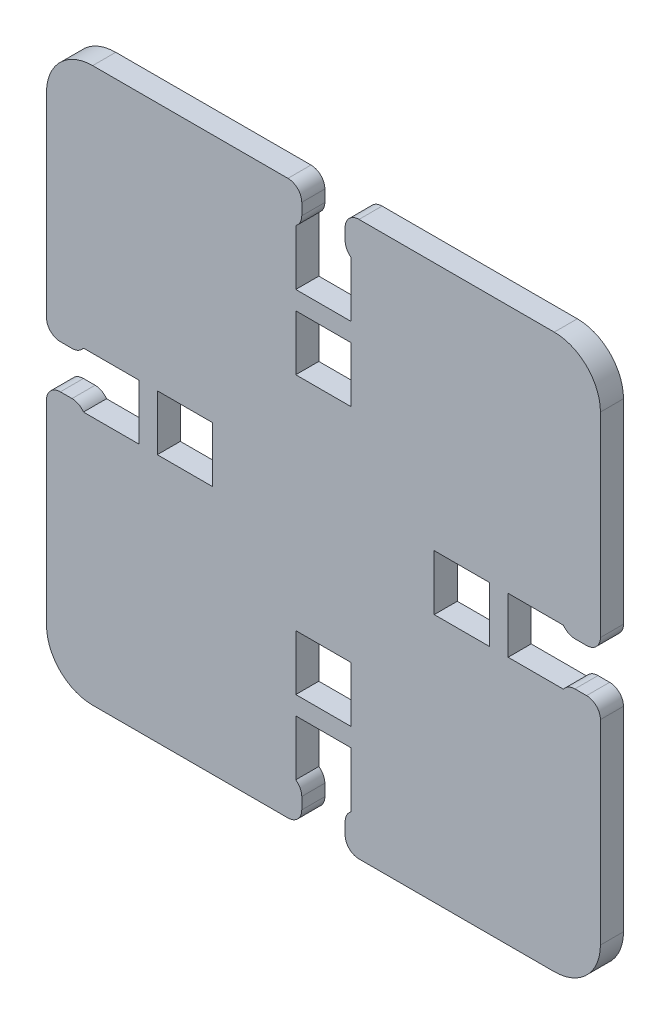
ISO-10303-21;
HEADER;
FILE_DESCRIPTION(('STEP AP214'),'2;1');
FILE_NAME('part.step','',(''),(''),'','','');
FILE_SCHEMA(('AUTOMOTIVE_DESIGN { 1 0 10303 214 1 1 1 1 }'));
ENDSEC;
DATA;
#1=APPLICATION_CONTEXT('core data for automotive mechanical design processes');
#2=APPLICATION_PROTOCOL_DEFINITION('international standard','automotive_design',2000,#1);
#3=PRODUCT_CONTEXT('',#1,'mechanical');
#4=PRODUCT('Part','Part','',(#3));
#5=PRODUCT_RELATED_PRODUCT_CATEGORY('part','',(#4));
#6=PRODUCT_DEFINITION_FORMATION('','',#4);
#7=PRODUCT_DEFINITION_CONTEXT('part definition',#1,'design');
#8=PRODUCT_DEFINITION('design','',#6,#7);
#9=PRODUCT_DEFINITION_SHAPE('','',#8);
#10=(LENGTH_UNIT() NAMED_UNIT(*) SI_UNIT(.MILLI.,.METRE.));
#11=(NAMED_UNIT(*) PLANE_ANGLE_UNIT() SI_UNIT($,.RADIAN.));
#12=(NAMED_UNIT(*) SI_UNIT($,.STERADIAN.) SOLID_ANGLE_UNIT());
#13=UNCERTAINTY_MEASURE_WITH_UNIT(LENGTH_MEASURE(1.E-05),#10,'distance_accuracy_value','');
#14=(GEOMETRIC_REPRESENTATION_CONTEXT(3) GLOBAL_UNCERTAINTY_ASSIGNED_CONTEXT((#13)) GLOBAL_UNIT_ASSIGNED_CONTEXT((#10,
#11,#12)) REPRESENTATION_CONTEXT('',''));
#15=CARTESIAN_POINT('',(0.,0.,0.));
#16=DIRECTION('',(0.,0.,1.));
#17=DIRECTION('',(1.,0.,0.));
#18=AXIS2_PLACEMENT_3D('',#15,#16,#17);
#19=CARTESIAN_POINT('',(0.,0.,2.5));
#20=DIRECTION('',(0.,0.,1.));
#21=DIRECTION('',(1.,0.,0.));
#22=AXIS2_PLACEMENT_3D('',#19,#20,#21);
#23=PLANE('',#22);
#24=DIRECTION('',(-1.,0.,0.));
#25=VECTOR('',#24,1.);
#26=CARTESIAN_POINT('',(-29.9999999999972,30.,2.5));
#27=LINE('',#26,#25);
#28=CARTESIAN_POINT('',(-3.85,30.,2.5));
#29=VERTEX_POINT('',#28);
#30=CARTESIAN_POINT('',(-24.999999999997,30.,2.5));
#31=VERTEX_POINT('',#30);
#32=EDGE_CURVE('E602',#29,#31,#27,.T.);
#33=ORIENTED_EDGE('',*,*,#32,.T.);
#34=CARTESIAN_POINT('',(-24.999999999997,25.,2.5));
#35=DIRECTION('',(0.,0.,1.));
#36=DIRECTION('',(1.,0.,0.));
#37=AXIS2_PLACEMENT_3D('',#34,#35,#36);
#38=CIRCLE('',#37,5.);
#39=CARTESIAN_POINT('',(-29.999999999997,24.9999999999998,2.5));
#40=VERTEX_POINT('',#39);
#41=EDGE_CURVE('E906',#31,#40,#38,.T.);
#42=ORIENTED_EDGE('',*,*,#41,.T.);
#43=DIRECTION('',(0.,-1.,0.));
#44=VECTOR('',#43,1.);
#45=CARTESIAN_POINT('',(-29.9999999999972,30.,2.5));
#46=LINE('',#45,#44);
#47=CARTESIAN_POINT('',(-29.9999999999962,3.84999999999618,2.5));
#48=VERTEX_POINT('',#47);
#49=EDGE_CURVE('E605',#40,#48,#46,.T.);
#50=ORIENTED_EDGE('',*,*,#49,.T.);
#51=CARTESIAN_POINT('',(-28.4999999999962,3.84999999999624,2.5));
#52=DIRECTION('',(0.,0.,1.));
#53=DIRECTION('',(1.,0.,0.));
#54=AXIS2_PLACEMENT_3D('',#51,#52,#53);
#55=CIRCLE('',#54,1.5);
#56=CARTESIAN_POINT('',(-28.4999999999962,2.34999999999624,2.5));
#57=VERTEX_POINT('',#56);
#58=EDGE_CURVE('E821',#48,#57,#55,.T.);
#59=ORIENTED_EDGE('',*,*,#58,.T.);
#60=DIRECTION('',(1.,0.,0.));
#61=VECTOR('',#60,1.);
#62=CARTESIAN_POINT('',(-29.9999999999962,2.34999999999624,2.5));
#63=LINE('',#62,#61);
#64=CARTESIAN_POINT('',(-27.2359207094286,2.34999999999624,2.5));
#65=VERTEX_POINT('',#64);
#66=EDGE_CURVE('E607',#57,#65,#63,.T.);
#67=ORIENTED_EDGE('',*,*,#66,.T.);
#68=CARTESIAN_POINT('',(-27.2359207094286,3.84999999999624,2.5));
#69=DIRECTION('',(0.,0.,1.));
#70=DIRECTION('',(1.,0.,0.));
#71=AXIS2_PLACEMENT_3D('',#68,#69,#70);
#72=CIRCLE('',#71,1.5);
#73=CARTESIAN_POINT('',(-25.9999999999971,2.99999999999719,2.5));
#74=VERTEX_POINT('',#73);
#75=EDGE_CURVE('E827',#65,#74,#72,.T.);
#76=ORIENTED_EDGE('',*,*,#75,.T.);
#77=DIRECTION('',(1.,0.,0.));
#78=VECTOR('',#77,1.);
#79=CARTESIAN_POINT('',(-25.9999999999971,2.99999999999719,2.5));
#80=LINE('',#79,#78);
#81=CARTESIAN_POINT('',(-19.9999999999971,2.99999999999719,2.5));
#82=VERTEX_POINT('',#81);
#83=EDGE_CURVE('E610',#74,#82,#80,.T.);
#84=ORIENTED_EDGE('',*,*,#83,.T.);
#85=DIRECTION('',(3.33645148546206E-13,-1.,0.));
#86=VECTOR('',#85,1.);
#87=CARTESIAN_POINT('',(-19.9999999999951,-3.00000000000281,2.5));
#88=LINE('',#87,#86);
#89=CARTESIAN_POINT('',(-19.9999999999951,-3.00000000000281,2.5));
#90=VERTEX_POINT('',#89);
#91=EDGE_CURVE('E612',#82,#90,#88,.T.);
#92=ORIENTED_EDGE('',*,*,#91,.T.);
#93=DIRECTION('',(-1.,0.,0.));
#94=VECTOR('',#93,1.);
#95=CARTESIAN_POINT('',(-25.9999999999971,-3.00000000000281,2.5));
#96=LINE('',#95,#94);
#97=CARTESIAN_POINT('',(-25.9999999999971,-3.00000000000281,2.5));
#98=VERTEX_POINT('',#97);
#99=EDGE_CURVE('E614',#90,#98,#96,.T.);
#100=ORIENTED_EDGE('',*,*,#99,.T.);
#101=CARTESIAN_POINT('',(-27.2359207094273,-3.85000000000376,2.5));
#102=DIRECTION('',(0.,0.,1.));
#103=DIRECTION('',(1.,0.,0.));
#104=AXIS2_PLACEMENT_3D('',#101,#102,#103);
#105=CIRCLE('',#104,1.5);
#106=CARTESIAN_POINT('',(-27.2359207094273,-2.35000000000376,2.5));
#107=VERTEX_POINT('',#106);
#108=EDGE_CURVE('E825',#98,#107,#105,.T.);
#109=ORIENTED_EDGE('',*,*,#108,.T.);
#110=DIRECTION('',(-1.,0.,0.));
#111=VECTOR('',#110,1.);
#112=CARTESIAN_POINT('',(-29.9999999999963,-2.35000000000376,2.5));
#113=LINE('',#112,#111);
#114=CARTESIAN_POINT('',(-28.4999999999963,-2.35000000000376,2.5));
#115=VERTEX_POINT('',#114);
#116=EDGE_CURVE('E616',#107,#115,#113,.T.);
#117=ORIENTED_EDGE('',*,*,#116,.T.);
#118=CARTESIAN_POINT('',(-28.4999999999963,-3.85000000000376,2.5));
#119=DIRECTION('',(0.,0.,1.));
#120=DIRECTION('',(1.,0.,0.));
#121=AXIS2_PLACEMENT_3D('',#118,#119,#120);
#122=CIRCLE('',#121,1.5);
#123=CARTESIAN_POINT('',(-29.9999999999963,-3.85000000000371,2.5));
#124=VERTEX_POINT('',#123);
#125=EDGE_CURVE('E823',#115,#124,#122,.T.);
#126=ORIENTED_EDGE('',*,*,#125,.T.);
#127=DIRECTION('',(0.,-1.,0.));
#128=VECTOR('',#127,1.);
#129=CARTESIAN_POINT('',(-29.9999999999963,-2.35000000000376,2.5));
#130=LINE('',#129,#128);
#131=CARTESIAN_POINT('',(-29.999999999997,-24.9999999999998,2.5));
#132=VERTEX_POINT('',#131);
#133=EDGE_CURVE('E619',#124,#132,#130,.T.);
#134=ORIENTED_EDGE('',*,*,#133,.T.);
#135=CARTESIAN_POINT('',(-24.999999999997,-25.,2.5));
#136=DIRECTION('',(0.,0.,1.));
#137=DIRECTION('',(1.,0.,0.));
#138=AXIS2_PLACEMENT_3D('',#135,#136,#137);
#139=CIRCLE('',#138,5.);
#140=CARTESIAN_POINT('',(-24.999999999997,-30.,2.5));
#141=VERTEX_POINT('',#140);
#142=EDGE_CURVE('E904',#132,#141,#139,.T.);
#143=ORIENTED_EDGE('',*,*,#142,.T.);
#144=DIRECTION('',(1.,0.,0.));
#145=VECTOR('',#144,1.);
#146=CARTESIAN_POINT('',(-29.9999999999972,-30.,2.5));
#147=LINE('',#146,#145);
#148=CARTESIAN_POINT('',(-3.84999999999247,-29.9999999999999,2.5));
#149=VERTEX_POINT('',#148);
#150=EDGE_CURVE('E622',#141,#149,#147,.T.);
#151=ORIENTED_EDGE('',*,*,#150,.T.);
#152=CARTESIAN_POINT('',(-3.84999999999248,-28.4999999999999,2.5));
#153=DIRECTION('',(0.,0.,1.));
#154=DIRECTION('',(1.,0.,0.));
#155=AXIS2_PLACEMENT_3D('',#152,#153,#154);
#156=CIRCLE('',#155,1.5);
#157=CARTESIAN_POINT('',(-2.34999999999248,-28.4999999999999,2.5));
#158=VERTEX_POINT('',#157);
#159=EDGE_CURVE('E815',#149,#158,#156,.T.);
#160=ORIENTED_EDGE('',*,*,#159,.T.);
#161=DIRECTION('',(0.,1.,0.));
#162=VECTOR('',#161,1.);
#163=CARTESIAN_POINT('',(-2.34999999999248,-29.9999999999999,2.5));
#164=LINE('',#163,#162);
#165=CARTESIAN_POINT('',(-2.34999999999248,-27.235920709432,2.5));
#166=VERTEX_POINT('',#165);
#167=EDGE_CURVE('E624',#158,#166,#164,.T.);
#168=ORIENTED_EDGE('',*,*,#167,.T.);
#169=CARTESIAN_POINT('',(-3.84999999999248,-27.235920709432,2.5));
#170=DIRECTION('',(0.,0.,1.));
#171=DIRECTION('',(1.,0.,0.));
#172=AXIS2_PLACEMENT_3D('',#169,#170,#171);
#173=CIRCLE('',#172,1.5);
#174=CARTESIAN_POINT('',(-2.99999999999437,-25.9999999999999,2.5));
#175=VERTEX_POINT('',#174);
#176=EDGE_CURVE('E817',#166,#175,#173,.T.);
#177=ORIENTED_EDGE('',*,*,#176,.T.);
#178=DIRECTION('',(0.,1.,0.));
#179=VECTOR('',#178,1.);
#180=CARTESIAN_POINT('',(-2.99999999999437,-25.9999999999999,2.5));
#181=LINE('',#180,#179);
#182=CARTESIAN_POINT('',(-2.99999999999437,-19.9999999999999,2.5));
#183=VERTEX_POINT('',#182);
#184=EDGE_CURVE('E627',#175,#183,#181,.T.);
#185=ORIENTED_EDGE('',*,*,#184,.T.);
#186=DIRECTION('',(1.,3.33066907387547E-13,0.));
#187=VECTOR('',#186,1.);
#188=CARTESIAN_POINT('',(3.00000000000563,-19.9999999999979,2.5));
#189=LINE('',#188,#187);
#190=CARTESIAN_POINT('',(3.00000000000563,-19.9999999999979,2.5));
#191=VERTEX_POINT('',#190);
#192=EDGE_CURVE('E629',#183,#191,#189,.T.);
#193=ORIENTED_EDGE('',*,*,#192,.T.);
#194=DIRECTION('',(0.,-1.,0.));
#195=VECTOR('',#194,1.);
#196=CARTESIAN_POINT('',(3.00000000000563,-25.9999999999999,2.5));
#197=LINE('',#196,#195);
#198=CARTESIAN_POINT('',(3.00000000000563,-25.9999999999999,2.5));
#199=VERTEX_POINT('',#198);
#200=EDGE_CURVE('E631',#191,#199,#197,.T.);
#201=ORIENTED_EDGE('',*,*,#200,.T.);
#202=CARTESIAN_POINT('',(3.85000000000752,-27.2359207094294,2.5));
#203=DIRECTION('',(0.,0.,1.));
#204=DIRECTION('',(1.,0.,0.));
#205=AXIS2_PLACEMENT_3D('',#202,#203,#204);
#206=CIRCLE('',#205,1.5);
#207=CARTESIAN_POINT('',(2.35000000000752,-27.2359207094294,2.5));
#208=VERTEX_POINT('',#207);
#209=EDGE_CURVE('E819',#199,#208,#206,.T.);
#210=ORIENTED_EDGE('',*,*,#209,.T.);
#211=DIRECTION('',(0.,-1.,0.));
#212=VECTOR('',#211,1.);
#213=CARTESIAN_POINT('',(2.35000000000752,-30.,2.5));
#214=LINE('',#213,#212);
#215=CARTESIAN_POINT('',(2.35000000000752,-28.5,2.5));
#216=VERTEX_POINT('',#215);
#217=EDGE_CURVE('E633',#208,#216,#214,.T.);
#218=ORIENTED_EDGE('',*,*,#217,.T.);
#219=CARTESIAN_POINT('',(3.85000000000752,-28.5,2.5));
#220=DIRECTION('',(0.,0.,1.));
#221=DIRECTION('',(1.,0.,0.));
#222=AXIS2_PLACEMENT_3D('',#219,#220,#221);
#223=CIRCLE('',#222,1.5);
#224=CARTESIAN_POINT('',(3.85000000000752,-30.,2.5));
#225=VERTEX_POINT('',#224);
#226=EDGE_CURVE('E813',#216,#225,#223,.T.);
#227=ORIENTED_EDGE('',*,*,#226,.T.);
#228=DIRECTION('',(1.,0.,0.));
#229=VECTOR('',#228,1.);
#230=CARTESIAN_POINT('',(2.35000000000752,-30.,2.5));
#231=LINE('',#230,#229);
#232=CARTESIAN_POINT('',(25.000000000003,-30.,2.5));
#233=VERTEX_POINT('',#232);
#234=EDGE_CURVE('E636',#225,#233,#231,.T.);
#235=ORIENTED_EDGE('',*,*,#234,.T.);
#236=CARTESIAN_POINT('',(25.000000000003,-25.,2.5));
#237=DIRECTION('',(0.,0.,1.));
#238=DIRECTION('',(1.,0.,0.));
#239=AXIS2_PLACEMENT_3D('',#236,#237,#238);
#240=CIRCLE('',#239,5.);
#241=CARTESIAN_POINT('',(30.000000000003,-25.0000000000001,2.5));
#242=VERTEX_POINT('',#241);
#243=EDGE_CURVE('E902',#233,#242,#240,.T.);
#244=ORIENTED_EDGE('',*,*,#243,.T.);
#245=DIRECTION('',(0.,1.,0.));
#246=VECTOR('',#245,1.);
#247=CARTESIAN_POINT('',(30.0000000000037,-2.34999999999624,2.5));
#248=LINE('',#247,#246);
#249=CARTESIAN_POINT('',(30.0000000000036,-3.84999999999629,2.5));
#250=VERTEX_POINT('',#249);
#251=EDGE_CURVE('E571',#242,#250,#248,.T.);
#252=ORIENTED_EDGE('',*,*,#251,.T.);
#253=CARTESIAN_POINT('',(28.5000000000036,-3.84999999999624,2.5));
#254=DIRECTION('',(0.,0.,1.));
#255=DIRECTION('',(1.,0.,0.));
#256=AXIS2_PLACEMENT_3D('',#253,#254,#255);
#257=CIRCLE('',#256,1.5);
#258=CARTESIAN_POINT('',(28.5000000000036,-2.34999999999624,2.5));
#259=VERTEX_POINT('',#258);
#260=EDGE_CURVE('E809',#250,#259,#257,.T.);
#261=ORIENTED_EDGE('',*,*,#260,.T.);
#262=DIRECTION('',(-1.,0.,0.));
#263=VECTOR('',#262,1.);
#264=CARTESIAN_POINT('',(30.0000000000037,-2.34999999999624,2.5));
#265=LINE('',#264,#263);
#266=CARTESIAN_POINT('',(27.2359207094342,-2.34999999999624,2.5));
#267=VERTEX_POINT('',#266);
#268=EDGE_CURVE('E573',#259,#267,#265,.T.);
#269=ORIENTED_EDGE('',*,*,#268,.T.);
#270=CARTESIAN_POINT('',(27.2359207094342,-3.84999999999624,2.5));
#271=DIRECTION('',(0.,0.,1.));
#272=DIRECTION('',(1.,0.,0.));
#273=AXIS2_PLACEMENT_3D('',#270,#271,#272);
#274=CIRCLE('',#273,1.5);
#275=CARTESIAN_POINT('',(26.0000000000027,-2.99999999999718,2.5));
#276=VERTEX_POINT('',#275);
#277=EDGE_CURVE('E811',#267,#276,#274,.T.);
#278=ORIENTED_EDGE('',*,*,#277,.T.);
#279=DIRECTION('',(-1.,0.,0.));
#280=VECTOR('',#279,1.);
#281=CARTESIAN_POINT('',(26.0000000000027,-2.99999999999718,2.5));
#282=LINE('',#281,#280);
#283=CARTESIAN_POINT('',(20.0000000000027,-2.99999999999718,2.5));
#284=VERTEX_POINT('',#283);
#285=EDGE_CURVE('E577',#276,#284,#282,.T.);
#286=ORIENTED_EDGE('',*,*,#285,.T.);
#287=DIRECTION('',(-3.33645148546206E-13,1.,0.));
#288=VECTOR('',#287,1.);
#289=CARTESIAN_POINT('',(20.0000000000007,3.00000000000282,2.5));
#290=LINE('',#289,#288);
#291=CARTESIAN_POINT('',(20.0000000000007,3.00000000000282,2.5));
#292=VERTEX_POINT('',#291);
#293=EDGE_CURVE('E579',#284,#292,#290,.T.);
#294=ORIENTED_EDGE('',*,*,#293,.T.);
#295=DIRECTION('',(1.,0.,0.));
#296=VECTOR('',#295,1.);
#297=CARTESIAN_POINT('',(26.0000000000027,3.00000000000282,2.5));
#298=LINE('',#297,#296);
#299=CARTESIAN_POINT('',(26.0000000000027,3.00000000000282,2.5));
#300=VERTEX_POINT('',#299);
#301=EDGE_CURVE('E581',#292,#300,#298,.T.);
#302=ORIENTED_EDGE('',*,*,#301,.T.);
#303=CARTESIAN_POINT('',(27.2359207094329,3.85000000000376,2.5));
#304=DIRECTION('',(0.,0.,1.));
#305=DIRECTION('',(1.,0.,0.));
#306=AXIS2_PLACEMENT_3D('',#303,#304,#305);
#307=CIRCLE('',#306,1.5);
#308=CARTESIAN_POINT('',(27.2359207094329,2.35000000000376,2.5));
#309=VERTEX_POINT('',#308);
#310=EDGE_CURVE('E805',#300,#309,#307,.T.);
#311=ORIENTED_EDGE('',*,*,#310,.T.);
#312=DIRECTION('',(1.,0.,0.));
#313=VECTOR('',#312,1.);
#314=CARTESIAN_POINT('',(30.0000000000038,2.35000000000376,2.5));
#315=LINE('',#314,#313);
#316=CARTESIAN_POINT('',(28.5000000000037,2.35000000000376,2.5));
#317=VERTEX_POINT('',#316);
#318=EDGE_CURVE('E583',#309,#317,#315,.T.);
#319=ORIENTED_EDGE('',*,*,#318,.T.);
#320=CARTESIAN_POINT('',(28.5000000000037,3.85000000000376,2.5));
#321=DIRECTION('',(0.,0.,1.));
#322=DIRECTION('',(1.,0.,0.));
#323=AXIS2_PLACEMENT_3D('',#320,#321,#322);
#324=CIRCLE('',#323,1.5);
#325=CARTESIAN_POINT('',(30.0000000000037,3.85000000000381,2.5));
#326=VERTEX_POINT('',#325);
#327=EDGE_CURVE('E807',#317,#326,#324,.T.);
#328=ORIENTED_EDGE('',*,*,#327,.T.);
#329=DIRECTION('',(0.,1.,0.));
#330=VECTOR('',#329,1.);
#331=CARTESIAN_POINT('',(30.0000000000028,30.,2.5));
#332=LINE('',#331,#330);
#333=CARTESIAN_POINT('',(30.000000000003,25.0000000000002,2.5));
#334=VERTEX_POINT('',#333);
#335=EDGE_CURVE('E586',#326,#334,#332,.T.);
#336=ORIENTED_EDGE('',*,*,#335,.T.);
#337=CARTESIAN_POINT('',(25.000000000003,25.,2.5));
#338=DIRECTION('',(0.,0.,1.));
#339=DIRECTION('',(1.,0.,0.));
#340=AXIS2_PLACEMENT_3D('',#337,#338,#339);
#341=CIRCLE('',#340,5.);
#342=CARTESIAN_POINT('',(25.000000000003,30.,2.5));
#343=VERTEX_POINT('',#342);
#344=EDGE_CURVE('E50',#334,#343,#341,.T.);
#345=ORIENTED_EDGE('',*,*,#344,.T.);
#346=DIRECTION('',(-1.,0.,0.));
#347=VECTOR('',#346,1.);
#348=CARTESIAN_POINT('',(2.35,29.9999999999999,2.5));
#349=LINE('',#348,#347);
#350=CARTESIAN_POINT('',(3.85,29.9999999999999,2.5));
#351=VERTEX_POINT('',#350);
#352=EDGE_CURVE('E588',#343,#351,#349,.T.);
#353=ORIENTED_EDGE('',*,*,#352,.T.);
#354=CARTESIAN_POINT('',(3.85,28.4999999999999,2.5));
#355=DIRECTION('',(0.,0.,1.));
#356=DIRECTION('',(1.,0.,0.));
#357=AXIS2_PLACEMENT_3D('',#354,#355,#356);
#358=CIRCLE('',#357,1.5);
#359=CARTESIAN_POINT('',(2.35,28.4999999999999,2.5));
#360=VERTEX_POINT('',#359);
#361=EDGE_CURVE('E799',#351,#360,#358,.T.);
#362=ORIENTED_EDGE('',*,*,#361,.T.);
#363=DIRECTION('',(0.,-1.,0.));
#364=VECTOR('',#363,1.);
#365=CARTESIAN_POINT('',(2.35,29.9999999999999,2.5));
#366=LINE('',#365,#364);
#367=CARTESIAN_POINT('',(2.35,27.2359207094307,2.5));
#368=VERTEX_POINT('',#367);
#369=EDGE_CURVE('E590',#360,#368,#366,.T.);
#370=ORIENTED_EDGE('',*,*,#369,.T.);
#371=CARTESIAN_POINT('',(3.85,27.2359207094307,2.5));
#372=DIRECTION('',(0.,0.,1.));
#373=DIRECTION('',(1.,0.,0.));
#374=AXIS2_PLACEMENT_3D('',#371,#372,#373);
#375=CIRCLE('',#374,1.5);
#376=CARTESIAN_POINT('',(3.,25.9999999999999,2.5));
#377=VERTEX_POINT('',#376);
#378=EDGE_CURVE('E801',#368,#377,#375,.T.);
#379=ORIENTED_EDGE('',*,*,#378,.T.);
#380=DIRECTION('',(0.,-1.,0.));
#381=VECTOR('',#380,1.);
#382=CARTESIAN_POINT('',(3.,25.9999999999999,2.5));
#383=LINE('',#382,#381);
#384=CARTESIAN_POINT('',(3.,19.9999999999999,2.5));
#385=VERTEX_POINT('',#384);
#386=EDGE_CURVE('E593',#377,#385,#383,.T.);
#387=ORIENTED_EDGE('',*,*,#386,.T.);
#388=DIRECTION('',(-1.,-3.33066907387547E-13,0.));
#389=VECTOR('',#388,1.);
#390=CARTESIAN_POINT('',(-3.,19.9999999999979,2.5));
#391=LINE('',#390,#389);
#392=CARTESIAN_POINT('',(-3.,19.9999999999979,2.5));
#393=VERTEX_POINT('',#392);
#394=EDGE_CURVE('E595',#385,#393,#391,.T.);
#395=ORIENTED_EDGE('',*,*,#394,.T.);
#396=DIRECTION('',(0.,1.,0.));
#397=VECTOR('',#396,1.);
#398=CARTESIAN_POINT('',(-3.,25.9999999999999,2.5));
#399=LINE('',#398,#397);
#400=CARTESIAN_POINT('',(-3.,25.9999999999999,2.5));
#401=VERTEX_POINT('',#400);
#402=EDGE_CURVE('E597',#393,#401,#399,.T.);
#403=ORIENTED_EDGE('',*,*,#402,.T.);
#404=CARTESIAN_POINT('',(-3.85,27.2359207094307,2.5));
#405=DIRECTION('',(0.,0.,1.));
#406=DIRECTION('',(1.,0.,0.));
#407=AXIS2_PLACEMENT_3D('',#404,#405,#406);
#408=CIRCLE('',#407,1.5);
#409=CARTESIAN_POINT('',(-2.35,27.2359207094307,2.5));
#410=VERTEX_POINT('',#409);
#411=EDGE_CURVE('E803',#401,#410,#408,.T.);
#412=ORIENTED_EDGE('',*,*,#411,.T.);
#413=DIRECTION('',(0.,1.,0.));
#414=VECTOR('',#413,1.);
#415=CARTESIAN_POINT('',(-2.35,30.,2.5));
#416=LINE('',#415,#414);
#417=CARTESIAN_POINT('',(-2.35,28.5,2.5));
#418=VERTEX_POINT('',#417);
#419=EDGE_CURVE('E599',#410,#418,#416,.T.);
#420=ORIENTED_EDGE('',*,*,#419,.T.);
#421=CARTESIAN_POINT('',(-3.85,28.5,2.5));
#422=DIRECTION('',(0.,0.,1.));
#423=DIRECTION('',(1.,0.,0.));
#424=AXIS2_PLACEMENT_3D('',#421,#422,#423);
#425=CIRCLE('',#424,1.5);
#426=EDGE_CURVE('E797',#418,#29,#425,.T.);
#427=ORIENTED_EDGE('',*,*,#426,.T.);
#428=EDGE_LOOP('',(#33,#42,#50,#59,#67,#76,#84,#92,#100,#109,#117,#126,#134,#143,#151,#160,#168,
#177,#185,#193,#201,#210,#218,#227,#235,#244,#252,#261,#269,#278,#286,#294,#302,#311,#319,#328,
#336,#345,#353,#362,#370,#379,#387,#395,#403,#412,#420,#427));
#429=FACE_BOUND('',#428,.T.);
#430=DIRECTION('',(1.,0.,0.));
#431=VECTOR('',#430,1.);
#432=CARTESIAN_POINT('',(-3.,11.9999999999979,2.5));
#433=LINE('',#432,#431);
#434=CARTESIAN_POINT('',(-3.,11.9999999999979,2.5));
#435=VERTEX_POINT('',#434);
#436=CARTESIAN_POINT('',(3.,11.9999999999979,2.5));
#437=VERTEX_POINT('',#436);
#438=EDGE_CURVE('E542',#435,#437,#433,.T.);
#439=ORIENTED_EDGE('',*,*,#438,.F.);
#440=DIRECTION('',(0.,-1.,0.));
#441=VECTOR('',#440,1.);
#442=CARTESIAN_POINT('',(-3.,17.9999999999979,2.5));
#443=LINE('',#442,#441);
#444=CARTESIAN_POINT('',(-3.,17.9999999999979,2.5));
#445=VERTEX_POINT('',#444);
#446=EDGE_CURVE('E540',#445,#435,#443,.T.);
#447=ORIENTED_EDGE('',*,*,#446,.F.);
#448=DIRECTION('',(-1.,0.,0.));
#449=VECTOR('',#448,1.);
#450=CARTESIAN_POINT('',(-3.,17.9999999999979,2.5));
#451=LINE('',#450,#449);
#452=CARTESIAN_POINT('',(3.,17.9999999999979,2.5));
#453=VERTEX_POINT('',#452);
#454=EDGE_CURVE('E548',#453,#445,#451,.T.);
#455=ORIENTED_EDGE('',*,*,#454,.F.);
#456=DIRECTION('',(0.,1.,0.));
#457=VECTOR('',#456,1.);
#458=CARTESIAN_POINT('',(3.,17.9999999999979,2.5));
#459=LINE('',#458,#457);
#460=EDGE_CURVE('E545',#437,#453,#459,.T.);
#461=ORIENTED_EDGE('',*,*,#460,.F.);
#462=EDGE_LOOP('',(#439,#447,#455,#461));
#463=FACE_BOUND('',#462,.T.);
#464=DIRECTION('',(-1.,0.,0.));
#465=VECTOR('',#464,1.);
#466=CARTESIAN_POINT('',(18.0000000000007,3.00000000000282,2.5));
#467=LINE('',#466,#465);
#468=CARTESIAN_POINT('',(18.0000000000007,3.00000000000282,2.5));
#469=VERTEX_POINT('',#468);
#470=CARTESIAN_POINT('',(12.0000000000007,3.00000000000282,2.5));
#471=VERTEX_POINT('',#470);
#472=EDGE_CURVE('E511',#469,#471,#467,.T.);
#473=ORIENTED_EDGE('',*,*,#472,.F.);
#474=DIRECTION('',(0.,1.,0.));
#475=VECTOR('',#474,1.);
#476=CARTESIAN_POINT('',(18.0000000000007,3.00000000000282,2.5));
#477=LINE('',#476,#475);
#478=CARTESIAN_POINT('',(18.0000000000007,-2.99999999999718,2.5));
#479=VERTEX_POINT('',#478);
#480=EDGE_CURVE('E509',#479,#469,#477,.T.);
#481=ORIENTED_EDGE('',*,*,#480,.F.);
#482=DIRECTION('',(1.,0.,0.));
#483=VECTOR('',#482,1.);
#484=CARTESIAN_POINT('',(18.0000000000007,-2.99999999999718,2.5));
#485=LINE('',#484,#483);
#486=CARTESIAN_POINT('',(12.0000000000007,-2.99999999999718,2.5));
#487=VERTEX_POINT('',#486);
#488=EDGE_CURVE('E517',#487,#479,#485,.T.);
#489=ORIENTED_EDGE('',*,*,#488,.F.);
#490=DIRECTION('',(0.,-1.,0.));
#491=VECTOR('',#490,1.);
#492=CARTESIAN_POINT('',(12.0000000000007,3.00000000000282,2.5));
#493=LINE('',#492,#491);
#494=EDGE_CURVE('E514',#471,#487,#493,.T.);
#495=ORIENTED_EDGE('',*,*,#494,.F.);
#496=EDGE_LOOP('',(#473,#481,#489,#495));
#497=FACE_BOUND('',#496,.T.);
#498=DIRECTION('',(0.,1.,0.));
#499=VECTOR('',#498,1.);
#500=CARTESIAN_POINT('',(3.00000000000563,-17.9999999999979,2.5));
#501=LINE('',#500,#499);
#502=CARTESIAN_POINT('',(3.00000000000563,-17.9999999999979,2.5));
#503=VERTEX_POINT('',#502);
#504=CARTESIAN_POINT('',(3.00000000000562,-11.9999999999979,2.5));
#505=VERTEX_POINT('',#504);
#506=EDGE_CURVE('E480',#503,#505,#501,.T.);
#507=ORIENTED_EDGE('',*,*,#506,.F.);
#508=DIRECTION('',(1.,0.,0.));
#509=VECTOR('',#508,1.);
#510=CARTESIAN_POINT('',(3.00000000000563,-17.9999999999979,2.5));
#511=LINE('',#510,#509);
#512=CARTESIAN_POINT('',(-2.99999999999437,-17.9999999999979,2.5));
#513=VERTEX_POINT('',#512);
#514=EDGE_CURVE('E478',#513,#503,#511,.T.);
#515=ORIENTED_EDGE('',*,*,#514,.F.);
#516=DIRECTION('',(0.,-1.,0.));
#517=VECTOR('',#516,1.);
#518=CARTESIAN_POINT('',(-2.99999999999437,-17.9999999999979,2.5));
#519=LINE('',#518,#517);
#520=CARTESIAN_POINT('',(-2.99999999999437,-11.9999999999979,2.5));
#521=VERTEX_POINT('',#520);
#522=EDGE_CURVE('E486',#521,#513,#519,.T.);
#523=ORIENTED_EDGE('',*,*,#522,.F.);
#524=DIRECTION('',(-1.,0.,0.));
#525=VECTOR('',#524,1.);
#526=CARTESIAN_POINT('',(3.00000000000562,-11.9999999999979,2.5));
#527=LINE('',#526,#525);
#528=EDGE_CURVE('E483',#505,#521,#527,.T.);
#529=ORIENTED_EDGE('',*,*,#528,.F.);
#530=EDGE_LOOP('',(#507,#515,#523,#529));
#531=FACE_BOUND('',#530,.T.);
#532=DIRECTION('',(1.,0.,0.));
#533=VECTOR('',#532,1.);
#534=CARTESIAN_POINT('',(-17.9999999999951,-3.00000000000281,2.5));
#535=LINE('',#534,#533);
#536=CARTESIAN_POINT('',(-17.9999999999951,-3.00000000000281,2.5));
#537=VERTEX_POINT('',#536);
#538=CARTESIAN_POINT('',(-11.9999999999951,-3.00000000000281,2.5));
#539=VERTEX_POINT('',#538);
#540=EDGE_CURVE('E447',#537,#539,#535,.T.);
#541=ORIENTED_EDGE('',*,*,#540,.F.);
#542=DIRECTION('',(0.,-1.,0.));
#543=VECTOR('',#542,1.);
#544=CARTESIAN_POINT('',(-17.9999999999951,-3.00000000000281,2.5));
#545=LINE('',#544,#543);
#546=CARTESIAN_POINT('',(-17.9999999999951,2.99999999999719,2.5));
#547=VERTEX_POINT('',#546);
#548=EDGE_CURVE('E437',#547,#537,#545,.T.);
#549=ORIENTED_EDGE('',*,*,#548,.F.);
#550=DIRECTION('',(-1.,0.,0.));
#551=VECTOR('',#550,1.);
#552=CARTESIAN_POINT('',(-17.9999999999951,2.99999999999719,2.5));
#553=LINE('',#552,#551);
#554=CARTESIAN_POINT('',(-11.9999999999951,2.99999999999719,2.5));
#555=VERTEX_POINT('',#554);
#556=EDGE_CURVE('E462',#555,#547,#553,.T.);
#557=ORIENTED_EDGE('',*,*,#556,.F.);
#558=DIRECTION('',(0.,1.,0.));
#559=VECTOR('',#558,1.);
#560=CARTESIAN_POINT('',(-11.9999999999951,-3.00000000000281,2.5));
#561=LINE('',#560,#559);
#562=EDGE_CURVE('E460',#539,#555,#561,.T.);
#563=ORIENTED_EDGE('',*,*,#562,.F.);
#564=EDGE_LOOP('',(#541,#549,#557,#563));
#565=FACE_BOUND('',#564,.T.);
#566=ADVANCED_FACE('F35',(#429,#463,#497,#531,#565),#23,.T.);
#567=CARTESIAN_POINT('',(0.,0.,0.));
#568=DIRECTION('',(0.,0.,1.));
#569=DIRECTION('',(1.,0.,0.));
#570=AXIS2_PLACEMENT_3D('',#567,#568,#569);
#571=PLANE('',#570);
#572=DIRECTION('',(1.,0.,0.));
#573=VECTOR('',#572,1.);
#574=CARTESIAN_POINT('',(3.00000000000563,-17.9999999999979,0.));
#575=LINE('',#574,#573);
#576=CARTESIAN_POINT('',(-2.99999999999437,-17.9999999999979,0.));
#577=VERTEX_POINT('',#576);
#578=CARTESIAN_POINT('',(3.00000000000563,-17.9999999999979,0.));
#579=VERTEX_POINT('',#578);
#580=EDGE_CURVE('E455',#577,#579,#575,.T.);
#581=ORIENTED_EDGE('',*,*,#580,.T.);
#582=DIRECTION('',(0.,1.,0.));
#583=VECTOR('',#582,1.);
#584=CARTESIAN_POINT('',(3.00000000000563,-17.9999999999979,0.));
#585=LINE('',#584,#583);
#586=CARTESIAN_POINT('',(3.00000000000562,-11.9999999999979,0.));
#587=VERTEX_POINT('',#586);
#588=EDGE_CURVE('E491',#579,#587,#585,.T.);
#589=ORIENTED_EDGE('',*,*,#588,.T.);
#590=DIRECTION('',(-1.,0.,0.));
#591=VECTOR('',#590,1.);
#592=CARTESIAN_POINT('',(3.00000000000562,-11.9999999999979,0.));
#593=LINE('',#592,#591);
#594=CARTESIAN_POINT('',(-2.99999999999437,-11.9999999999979,0.));
#595=VERTEX_POINT('',#594);
#596=EDGE_CURVE('E494',#587,#595,#593,.T.);
#597=ORIENTED_EDGE('',*,*,#596,.T.);
#598=DIRECTION('',(0.,-1.,0.));
#599=VECTOR('',#598,1.);
#600=CARTESIAN_POINT('',(-2.99999999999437,-17.9999999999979,0.));
#601=LINE('',#600,#599);
#602=EDGE_CURVE('E481',#595,#577,#601,.T.);
#603=ORIENTED_EDGE('',*,*,#602,.T.);
#604=EDGE_LOOP('',(#581,#589,#597,#603));
#605=FACE_BOUND('',#604,.T.);
#606=DIRECTION('',(0.,-1.,0.));
#607=VECTOR('',#606,1.);
#608=CARTESIAN_POINT('',(-3.,17.9999999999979,0.));
#609=LINE('',#608,#607);
#610=CARTESIAN_POINT('',(-3.,17.9999999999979,0.));
#611=VERTEX_POINT('',#610);
#612=CARTESIAN_POINT('',(-3.,11.9999999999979,0.));
#613=VERTEX_POINT('',#612);
#614=EDGE_CURVE('E539',#611,#613,#609,.T.);
#615=ORIENTED_EDGE('',*,*,#614,.T.);
#616=DIRECTION('',(1.,0.,0.));
#617=VECTOR('',#616,1.);
#618=CARTESIAN_POINT('',(-3.,11.9999999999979,0.));
#619=LINE('',#618,#617);
#620=CARTESIAN_POINT('',(3.,11.9999999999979,0.));
#621=VERTEX_POINT('',#620);
#622=EDGE_CURVE('E553',#613,#621,#619,.T.);
#623=ORIENTED_EDGE('',*,*,#622,.T.);
#624=DIRECTION('',(0.,1.,0.));
#625=VECTOR('',#624,1.);
#626=CARTESIAN_POINT('',(3.,17.9999999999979,0.));
#627=LINE('',#626,#625);
#628=CARTESIAN_POINT('',(3.,17.9999999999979,0.));
#629=VERTEX_POINT('',#628);
#630=EDGE_CURVE('E556',#621,#629,#627,.T.);
#631=ORIENTED_EDGE('',*,*,#630,.T.);
#632=DIRECTION('',(-1.,0.,0.));
#633=VECTOR('',#632,1.);
#634=CARTESIAN_POINT('',(-3.,17.9999999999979,0.));
#635=LINE('',#634,#633);
#636=EDGE_CURVE('E543',#629,#611,#635,.T.);
#637=ORIENTED_EDGE('',*,*,#636,.T.);
#638=EDGE_LOOP('',(#615,#623,#631,#637));
#639=FACE_BOUND('',#638,.T.);
#640=DIRECTION('',(0.,-1.,0.));
#641=VECTOR('',#640,1.);
#642=CARTESIAN_POINT('',(-29.9999999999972,30.,0.));
#643=LINE('',#642,#641);
#644=CARTESIAN_POINT('',(-29.999999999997,24.9999999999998,0.));
#645=VERTEX_POINT('',#644);
#646=CARTESIAN_POINT('',(-29.9999999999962,3.84999999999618,0.));
#647=VERTEX_POINT('',#646);
#648=EDGE_CURVE('E674',#645,#647,#643,.T.);
#649=ORIENTED_EDGE('',*,*,#648,.F.);
#650=CARTESIAN_POINT('',(-24.999999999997,25.,0.));
#651=DIRECTION('',(0.,0.,1.));
#652=DIRECTION('',(1.,0.,0.));
#653=AXIS2_PLACEMENT_3D('',#650,#651,#652);
#654=CIRCLE('',#653,5.);
#655=CARTESIAN_POINT('',(-24.999999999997,30.,0.));
#656=VERTEX_POINT('',#655);
#657=EDGE_CURVE('E897',#645,#656,#654,.F.);
#658=ORIENTED_EDGE('',*,*,#657,.T.);
#659=DIRECTION('',(-1.,0.,0.));
#660=VECTOR('',#659,1.);
#661=CARTESIAN_POINT('',(-29.9999999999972,30.,0.));
#662=LINE('',#661,#660);
#663=CARTESIAN_POINT('',(-3.85,30.,0.));
#664=VERTEX_POINT('',#663);
#665=EDGE_CURVE('E671',#664,#656,#662,.T.);
#666=ORIENTED_EDGE('',*,*,#665,.F.);
#667=CARTESIAN_POINT('',(-3.85,28.5,0.));
#668=DIRECTION('',(0.,0.,1.));
#669=DIRECTION('',(1.,0.,0.));
#670=AXIS2_PLACEMENT_3D('',#667,#668,#669);
#671=CIRCLE('',#670,1.5);
#672=CARTESIAN_POINT('',(-2.35,28.5,0.));
#673=VERTEX_POINT('',#672);
#674=EDGE_CURVE('E756',#664,#673,#671,.F.);
#675=ORIENTED_EDGE('',*,*,#674,.T.);
#676=DIRECTION('',(0.,1.,0.));
#677=VECTOR('',#676,1.);
#678=CARTESIAN_POINT('',(-2.35,30.,0.));
#679=LINE('',#678,#677);
#680=CARTESIAN_POINT('',(-2.35,27.2359207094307,0.));
#681=VERTEX_POINT('',#680);
#682=EDGE_CURVE('E668',#681,#673,#679,.T.);
#683=ORIENTED_EDGE('',*,*,#682,.F.);
#684=CARTESIAN_POINT('',(-3.85,27.2359207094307,0.));
#685=DIRECTION('',(0.,0.,1.));
#686=DIRECTION('',(1.,0.,0.));
#687=AXIS2_PLACEMENT_3D('',#684,#685,#686);
#688=CIRCLE('',#687,1.5);
#689=CARTESIAN_POINT('',(-3.,25.9999999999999,0.));
#690=VERTEX_POINT('',#689);
#691=EDGE_CURVE('E763',#681,#690,#688,.F.);
#692=ORIENTED_EDGE('',*,*,#691,.T.);
#693=DIRECTION('',(0.,1.,0.));
#694=VECTOR('',#693,1.);
#695=CARTESIAN_POINT('',(-3.,25.9999999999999,0.));
#696=LINE('',#695,#694);
#697=CARTESIAN_POINT('',(-3.,19.9999999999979,0.));
#698=VERTEX_POINT('',#697);
#699=EDGE_CURVE('E665',#698,#690,#696,.T.);
#700=ORIENTED_EDGE('',*,*,#699,.F.);
#701=DIRECTION('',(-1.,-3.33066907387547E-13,0.));
#702=VECTOR('',#701,1.);
#703=CARTESIAN_POINT('',(-3.,19.9999999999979,0.));
#704=LINE('',#703,#702);
#705=CARTESIAN_POINT('',(3.,19.9999999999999,0.));
#706=VERTEX_POINT('',#705);
#707=EDGE_CURVE('E663',#706,#698,#704,.T.);
#708=ORIENTED_EDGE('',*,*,#707,.F.);
#709=DIRECTION('',(0.,-1.,0.));
#710=VECTOR('',#709,1.);
#711=CARTESIAN_POINT('',(3.,25.9999999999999,0.));
#712=LINE('',#711,#710);
#713=CARTESIAN_POINT('',(3.,25.9999999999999,0.));
#714=VERTEX_POINT('',#713);
#715=EDGE_CURVE('E661',#714,#706,#712,.T.);
#716=ORIENTED_EDGE('',*,*,#715,.F.);
#717=CARTESIAN_POINT('',(3.85,27.2359207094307,0.));
#718=DIRECTION('',(0.,0.,1.));
#719=DIRECTION('',(1.,0.,0.));
#720=AXIS2_PLACEMENT_3D('',#717,#718,#719);
#721=CIRCLE('',#720,1.5);
#722=CARTESIAN_POINT('',(2.35,27.2359207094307,0.));
#723=VERTEX_POINT('',#722);
#724=EDGE_CURVE('E761',#714,#723,#721,.F.);
#725=ORIENTED_EDGE('',*,*,#724,.T.);
#726=DIRECTION('',(0.,-1.,0.));
#727=VECTOR('',#726,1.);
#728=CARTESIAN_POINT('',(2.35,29.9999999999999,0.));
#729=LINE('',#728,#727);
#730=CARTESIAN_POINT('',(2.35,28.4999999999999,0.));
#731=VERTEX_POINT('',#730);
#732=EDGE_CURVE('E658',#731,#723,#729,.T.);
#733=ORIENTED_EDGE('',*,*,#732,.F.);
#734=CARTESIAN_POINT('',(3.85,28.4999999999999,0.));
#735=DIRECTION('',(0.,0.,1.));
#736=DIRECTION('',(1.,0.,0.));
#737=AXIS2_PLACEMENT_3D('',#734,#735,#736);
#738=CIRCLE('',#737,1.5);
#739=CARTESIAN_POINT('',(3.85,29.9999999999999,0.));
#740=VERTEX_POINT('',#739);
#741=EDGE_CURVE('E758',#731,#740,#738,.F.);
#742=ORIENTED_EDGE('',*,*,#741,.T.);
#743=DIRECTION('',(-1.,0.,0.));
#744=VECTOR('',#743,1.);
#745=CARTESIAN_POINT('',(2.35,29.9999999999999,0.));
#746=LINE('',#745,#744);
#747=CARTESIAN_POINT('',(25.000000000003,30.,0.));
#748=VERTEX_POINT('',#747);
#749=EDGE_CURVE('E656',#748,#740,#746,.T.);
#750=ORIENTED_EDGE('',*,*,#749,.F.);
#751=CARTESIAN_POINT('',(25.000000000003,25.,0.));
#752=DIRECTION('',(0.,0.,1.));
#753=DIRECTION('',(1.,0.,0.));
#754=AXIS2_PLACEMENT_3D('',#751,#752,#753);
#755=CIRCLE('',#754,5.);
#756=CARTESIAN_POINT('',(30.000000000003,25.0000000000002,0.));
#757=VERTEX_POINT('',#756);
#758=EDGE_CURVE('E891',#748,#757,#755,.F.);
#759=ORIENTED_EDGE('',*,*,#758,.T.);
#760=DIRECTION('',(0.,1.,0.));
#761=VECTOR('',#760,1.);
#762=CARTESIAN_POINT('',(30.0000000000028,30.,0.));
#763=LINE('',#762,#761);
#764=CARTESIAN_POINT('',(30.0000000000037,3.85000000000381,0.));
#765=VERTEX_POINT('',#764);
#766=EDGE_CURVE('E654',#765,#757,#763,.T.);
#767=ORIENTED_EDGE('',*,*,#766,.F.);
#768=CARTESIAN_POINT('',(28.5000000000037,3.85000000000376,0.));
#769=DIRECTION('',(0.,0.,1.));
#770=DIRECTION('',(1.,0.,0.));
#771=AXIS2_PLACEMENT_3D('',#768,#769,#770);
#772=CIRCLE('',#771,1.5);
#773=CARTESIAN_POINT('',(28.5000000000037,2.35000000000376,0.));
#774=VERTEX_POINT('',#773);
#775=EDGE_CURVE('E767',#765,#774,#772,.F.);
#776=ORIENTED_EDGE('',*,*,#775,.T.);
#777=DIRECTION('',(1.,0.,0.));
#778=VECTOR('',#777,1.);
#779=CARTESIAN_POINT('',(30.0000000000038,2.35000000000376,0.));
#780=LINE('',#779,#778);
#781=CARTESIAN_POINT('',(27.2359207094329,2.35000000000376,0.));
#782=VERTEX_POINT('',#781);
#783=EDGE_CURVE('E651',#782,#774,#780,.T.);
#784=ORIENTED_EDGE('',*,*,#783,.F.);
#785=CARTESIAN_POINT('',(27.2359207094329,3.85000000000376,0.));
#786=DIRECTION('',(0.,0.,1.));
#787=DIRECTION('',(1.,0.,0.));
#788=AXIS2_PLACEMENT_3D('',#785,#786,#787);
#789=CIRCLE('',#788,1.5);
#790=CARTESIAN_POINT('',(26.0000000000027,3.00000000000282,0.));
#791=VERTEX_POINT('',#790);
#792=EDGE_CURVE('E765',#782,#791,#789,.F.);
#793=ORIENTED_EDGE('',*,*,#792,.T.);
#794=DIRECTION('',(1.,0.,0.));
#795=VECTOR('',#794,1.);
#796=CARTESIAN_POINT('',(26.0000000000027,3.00000000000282,0.));
#797=LINE('',#796,#795);
#798=CARTESIAN_POINT('',(20.0000000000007,3.00000000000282,0.));
#799=VERTEX_POINT('',#798);
#800=EDGE_CURVE('E648',#799,#791,#797,.T.);
#801=ORIENTED_EDGE('',*,*,#800,.F.);
#802=DIRECTION('',(-3.33645148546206E-13,1.,0.));
#803=VECTOR('',#802,1.);
#804=CARTESIAN_POINT('',(20.0000000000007,3.00000000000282,0.));
#805=LINE('',#804,#803);
#806=CARTESIAN_POINT('',(20.0000000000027,-2.99999999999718,0.));
#807=VERTEX_POINT('',#806);
#808=EDGE_CURVE('E646',#807,#799,#805,.T.);
#809=ORIENTED_EDGE('',*,*,#808,.F.);
#810=DIRECTION('',(-1.,0.,0.));
#811=VECTOR('',#810,1.);
#812=CARTESIAN_POINT('',(26.0000000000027,-2.99999999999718,0.));
#813=LINE('',#812,#811);
#814=CARTESIAN_POINT('',(26.0000000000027,-2.99999999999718,0.));
#815=VERTEX_POINT('',#814);
#816=EDGE_CURVE('E644',#815,#807,#813,.T.);
#817=ORIENTED_EDGE('',*,*,#816,.F.);
#818=CARTESIAN_POINT('',(27.2359207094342,-3.84999999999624,0.));
#819=DIRECTION('',(0.,0.,1.));
#820=DIRECTION('',(1.,0.,0.));
#821=AXIS2_PLACEMENT_3D('',#818,#819,#820);
#822=CIRCLE('',#821,1.5);
#823=CARTESIAN_POINT('',(27.2359207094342,-2.34999999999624,0.));
#824=VERTEX_POINT('',#823);
#825=EDGE_CURVE('E772',#815,#824,#822,.F.);
#826=ORIENTED_EDGE('',*,*,#825,.T.);
#827=DIRECTION('',(-1.,0.,0.));
#828=VECTOR('',#827,1.);
#829=CARTESIAN_POINT('',(30.0000000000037,-2.34999999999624,0.));
#830=LINE('',#829,#828);
#831=CARTESIAN_POINT('',(28.5000000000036,-2.34999999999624,0.));
#832=VERTEX_POINT('',#831);
#833=EDGE_CURVE('E641',#832,#824,#830,.T.);
#834=ORIENTED_EDGE('',*,*,#833,.F.);
#835=CARTESIAN_POINT('',(28.5000000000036,-3.84999999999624,0.));
#836=DIRECTION('',(0.,0.,1.));
#837=DIRECTION('',(1.,0.,0.));
#838=AXIS2_PLACEMENT_3D('',#835,#836,#837);
#839=CIRCLE('',#838,1.5);
#840=CARTESIAN_POINT('',(30.0000000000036,-3.84999999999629,0.));
#841=VERTEX_POINT('',#840);
#842=EDGE_CURVE('E769',#832,#841,#839,.F.);
#843=ORIENTED_EDGE('',*,*,#842,.T.);
#844=DIRECTION('',(0.,1.,0.));
#845=VECTOR('',#844,1.);
#846=CARTESIAN_POINT('',(30.0000000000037,-2.34999999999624,0.));
#847=LINE('',#846,#845);
#848=CARTESIAN_POINT('',(30.000000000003,-25.0000000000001,0.));
#849=VERTEX_POINT('',#848);
#850=EDGE_CURVE('E570',#849,#841,#847,.T.);
#851=ORIENTED_EDGE('',*,*,#850,.F.);
#852=CARTESIAN_POINT('',(25.000000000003,-25.,0.));
#853=DIRECTION('',(0.,0.,1.));
#854=DIRECTION('',(1.,0.,0.));
#855=AXIS2_PLACEMENT_3D('',#852,#853,#854);
#856=CIRCLE('',#855,5.);
#857=CARTESIAN_POINT('',(25.000000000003,-30.,0.));
#858=VERTEX_POINT('',#857);
#859=EDGE_CURVE('E893',#849,#858,#856,.F.);
#860=ORIENTED_EDGE('',*,*,#859,.T.);
#861=DIRECTION('',(1.,0.,0.));
#862=VECTOR('',#861,1.);
#863=CARTESIAN_POINT('',(2.35000000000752,-30.,0.));
#864=LINE('',#863,#862);
#865=CARTESIAN_POINT('',(3.85000000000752,-30.,0.));
#866=VERTEX_POINT('',#865);
#867=EDGE_CURVE('E574',#866,#858,#864,.T.);
#868=ORIENTED_EDGE('',*,*,#867,.F.);
#869=CARTESIAN_POINT('',(3.85000000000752,-28.5,0.));
#870=DIRECTION('',(0.,0.,1.));
#871=DIRECTION('',(1.,0.,0.));
#872=AXIS2_PLACEMENT_3D('',#869,#870,#871);
#873=CIRCLE('',#872,1.5);
#874=CARTESIAN_POINT('',(2.35000000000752,-28.5,0.));
#875=VERTEX_POINT('',#874);
#876=EDGE_CURVE('E774',#866,#875,#873,.F.);
#877=ORIENTED_EDGE('',*,*,#876,.T.);
#878=DIRECTION('',(0.,-1.,0.));
#879=VECTOR('',#878,1.);
#880=CARTESIAN_POINT('',(2.35000000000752,-30.,0.));
#881=LINE('',#880,#879);
#882=CARTESIAN_POINT('',(2.35000000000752,-27.2359207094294,0.));
#883=VERTEX_POINT('',#882);
#884=EDGE_CURVE('E704',#883,#875,#881,.T.);
#885=ORIENTED_EDGE('',*,*,#884,.F.);
#886=CARTESIAN_POINT('',(3.85000000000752,-27.2359207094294,0.));
#887=DIRECTION('',(0.,0.,1.));
#888=DIRECTION('',(1.,0.,0.));
#889=AXIS2_PLACEMENT_3D('',#886,#887,#888);
#890=CIRCLE('',#889,1.5);
#891=CARTESIAN_POINT('',(3.00000000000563,-25.9999999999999,0.));
#892=VERTEX_POINT('',#891);
#893=EDGE_CURVE('E781',#883,#892,#890,.F.);
#894=ORIENTED_EDGE('',*,*,#893,.T.);
#895=DIRECTION('',(0.,-1.,0.));
#896=VECTOR('',#895,1.);
#897=CARTESIAN_POINT('',(3.00000000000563,-25.9999999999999,0.));
#898=LINE('',#897,#896);
#899=CARTESIAN_POINT('',(3.00000000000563,-19.9999999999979,0.));
#900=VERTEX_POINT('',#899);
#901=EDGE_CURVE('E701',#900,#892,#898,.T.);
#902=ORIENTED_EDGE('',*,*,#901,.F.);
#903=DIRECTION('',(1.,3.33066907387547E-13,0.));
#904=VECTOR('',#903,1.);
#905=CARTESIAN_POINT('',(3.00000000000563,-19.9999999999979,0.));
#906=LINE('',#905,#904);
#907=CARTESIAN_POINT('',(-2.99999999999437,-19.9999999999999,0.));
#908=VERTEX_POINT('',#907);
#909=EDGE_CURVE('E699',#908,#900,#906,.T.);
#910=ORIENTED_EDGE('',*,*,#909,.F.);
#911=DIRECTION('',(0.,1.,0.));
#912=VECTOR('',#911,1.);
#913=CARTESIAN_POINT('',(-2.99999999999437,-25.9999999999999,0.));
#914=LINE('',#913,#912);
#915=CARTESIAN_POINT('',(-2.99999999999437,-25.9999999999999,0.));
#916=VERTEX_POINT('',#915);
#917=EDGE_CURVE('E697',#916,#908,#914,.T.);
#918=ORIENTED_EDGE('',*,*,#917,.F.);
#919=CARTESIAN_POINT('',(-3.84999999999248,-27.235920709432,0.));
#920=DIRECTION('',(0.,0.,1.));
#921=DIRECTION('',(1.,0.,0.));
#922=AXIS2_PLACEMENT_3D('',#919,#920,#921);
#923=CIRCLE('',#922,1.5);
#924=CARTESIAN_POINT('',(-2.34999999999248,-27.235920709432,0.));
#925=VERTEX_POINT('',#924);
#926=EDGE_CURVE('E779',#916,#925,#923,.F.);
#927=ORIENTED_EDGE('',*,*,#926,.T.);
#928=DIRECTION('',(0.,1.,0.));
#929=VECTOR('',#928,1.);
#930=CARTESIAN_POINT('',(-2.34999999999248,-29.9999999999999,0.));
#931=LINE('',#930,#929);
#932=CARTESIAN_POINT('',(-2.34999999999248,-28.4999999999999,0.));
#933=VERTEX_POINT('',#932);
#934=EDGE_CURVE('E694',#933,#925,#931,.T.);
#935=ORIENTED_EDGE('',*,*,#934,.F.);
#936=CARTESIAN_POINT('',(-3.84999999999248,-28.4999999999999,0.));
#937=DIRECTION('',(0.,0.,1.));
#938=DIRECTION('',(1.,0.,0.));
#939=AXIS2_PLACEMENT_3D('',#936,#937,#938);
#940=CIRCLE('',#939,1.5);
#941=CARTESIAN_POINT('',(-3.84999999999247,-29.9999999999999,0.));
#942=VERTEX_POINT('',#941);
#943=EDGE_CURVE('E776',#933,#942,#940,.F.);
#944=ORIENTED_EDGE('',*,*,#943,.T.);
#945=DIRECTION('',(1.,0.,0.));
#946=VECTOR('',#945,1.);
#947=CARTESIAN_POINT('',(-29.9999999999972,-30.,0.));
#948=LINE('',#947,#946);
#949=CARTESIAN_POINT('',(-24.999999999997,-30.,0.));
#950=VERTEX_POINT('',#949);
#951=EDGE_CURVE('E692',#950,#942,#948,.T.);
#952=ORIENTED_EDGE('',*,*,#951,.F.);
#953=CARTESIAN_POINT('',(-24.999999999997,-25.,0.));
#954=DIRECTION('',(0.,0.,1.));
#955=DIRECTION('',(1.,0.,0.));
#956=AXIS2_PLACEMENT_3D('',#953,#954,#955);
#957=CIRCLE('',#956,5.);
#958=CARTESIAN_POINT('',(-29.999999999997,-24.9999999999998,0.));
#959=VERTEX_POINT('',#958);
#960=EDGE_CURVE('E895',#950,#959,#957,.F.);
#961=ORIENTED_EDGE('',*,*,#960,.T.);
#962=DIRECTION('',(0.,-1.,0.));
#963=VECTOR('',#962,1.);
#964=CARTESIAN_POINT('',(-29.9999999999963,-2.35000000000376,0.));
#965=LINE('',#964,#963);
#966=CARTESIAN_POINT('',(-29.9999999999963,-3.85000000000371,0.));
#967=VERTEX_POINT('',#966);
#968=EDGE_CURVE('E689',#967,#959,#965,.T.);
#969=ORIENTED_EDGE('',*,*,#968,.F.);
#970=CARTESIAN_POINT('',(-28.4999999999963,-3.85000000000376,0.));
#971=DIRECTION('',(0.,0.,1.));
#972=DIRECTION('',(1.,0.,0.));
#973=AXIS2_PLACEMENT_3D('',#970,#971,#972);
#974=CIRCLE('',#973,1.5);
#975=CARTESIAN_POINT('',(-28.4999999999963,-2.35000000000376,0.));
#976=VERTEX_POINT('',#975);
#977=EDGE_CURVE('E786',#967,#976,#974,.F.);
#978=ORIENTED_EDGE('',*,*,#977,.T.);
#979=DIRECTION('',(-1.,0.,0.));
#980=VECTOR('',#979,1.);
#981=CARTESIAN_POINT('',(-29.9999999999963,-2.35000000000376,0.));
#982=LINE('',#981,#980);
#983=CARTESIAN_POINT('',(-27.2359207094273,-2.35000000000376,0.));
#984=VERTEX_POINT('',#983);
#985=EDGE_CURVE('E686',#984,#976,#982,.T.);
#986=ORIENTED_EDGE('',*,*,#985,.F.);
#987=CARTESIAN_POINT('',(-27.2359207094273,-3.85000000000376,0.));
#988=DIRECTION('',(0.,0.,1.));
#989=DIRECTION('',(1.,0.,0.));
#990=AXIS2_PLACEMENT_3D('',#987,#988,#989);
#991=CIRCLE('',#990,1.5);
#992=CARTESIAN_POINT('',(-25.9999999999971,-3.00000000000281,0.));
#993=VERTEX_POINT('',#992);
#994=EDGE_CURVE('E788',#984,#993,#991,.F.);
#995=ORIENTED_EDGE('',*,*,#994,.T.);
#996=DIRECTION('',(-1.,0.,0.));
#997=VECTOR('',#996,1.);
#998=CARTESIAN_POINT('',(-25.9999999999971,-3.00000000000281,0.));
#999=LINE('',#998,#997);
#1000=CARTESIAN_POINT('',(-19.9999999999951,-3.00000000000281,0.));
#1001=VERTEX_POINT('',#1000);
#1002=EDGE_CURVE('E683',#1001,#993,#999,.T.);
#1003=ORIENTED_EDGE('',*,*,#1002,.F.);
#1004=DIRECTION('',(3.33645148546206E-13,-1.,0.));
#1005=VECTOR('',#1004,1.);
#1006=CARTESIAN_POINT('',(-19.9999999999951,-3.00000000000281,0.));
#1007=LINE('',#1006,#1005);
#1008=CARTESIAN_POINT('',(-19.9999999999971,2.99999999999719,0.));
#1009=VERTEX_POINT('',#1008);
#1010=EDGE_CURVE('E681',#1009,#1001,#1007,.T.);
#1011=ORIENTED_EDGE('',*,*,#1010,.F.);
#1012=DIRECTION('',(1.,0.,0.));
#1013=VECTOR('',#1012,1.);
#1014=CARTESIAN_POINT('',(-25.9999999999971,2.99999999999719,0.));
#1015=LINE('',#1014,#1013);
#1016=CARTESIAN_POINT('',(-25.9999999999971,2.99999999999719,0.));
#1017=VERTEX_POINT('',#1016);
#1018=EDGE_CURVE('E679',#1017,#1009,#1015,.T.);
#1019=ORIENTED_EDGE('',*,*,#1018,.F.);
#1020=CARTESIAN_POINT('',(-27.2359207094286,3.84999999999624,0.));
#1021=DIRECTION('',(0.,0.,1.));
#1022=DIRECTION('',(1.,0.,0.));
#1023=AXIS2_PLACEMENT_3D('',#1020,#1021,#1022);
#1024=CIRCLE('',#1023,1.5);
#1025=CARTESIAN_POINT('',(-27.2359207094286,2.34999999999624,0.));
#1026=VERTEX_POINT('',#1025);
#1027=EDGE_CURVE('E790',#1017,#1026,#1024,.F.);
#1028=ORIENTED_EDGE('',*,*,#1027,.T.);
#1029=DIRECTION('',(1.,0.,0.));
#1030=VECTOR('',#1029,1.);
#1031=CARTESIAN_POINT('',(-29.9999999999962,2.34999999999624,0.));
#1032=LINE('',#1031,#1030);
#1033=CARTESIAN_POINT('',(-28.4999999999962,2.34999999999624,0.));
#1034=VERTEX_POINT('',#1033);
#1035=EDGE_CURVE('E676',#1034,#1026,#1032,.T.);
#1036=ORIENTED_EDGE('',*,*,#1035,.F.);
#1037=CARTESIAN_POINT('',(-28.4999999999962,3.84999999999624,0.));
#1038=DIRECTION('',(0.,0.,1.));
#1039=DIRECTION('',(1.,0.,0.));
#1040=AXIS2_PLACEMENT_3D('',#1037,#1038,#1039);
#1041=CIRCLE('',#1040,1.5);
#1042=EDGE_CURVE('E783',#1034,#647,#1041,.F.);
#1043=ORIENTED_EDGE('',*,*,#1042,.T.);
#1044=EDGE_LOOP('',(#649,#658,#666,#675,#683,#692,#700,#708,#716,#725,#733,#742,#750,#759,#767,
#776,#784,#793,#801,#809,#817,#826,#834,#843,#851,#860,#868,#877,#885,#894,#902,#910,#918,#927,
#935,#944,#952,#961,#969,#978,#986,#995,#1003,#1011,#1019,#1028,#1036,#1043));
#1045=FACE_BOUND('',#1044,.T.);
#1046=DIRECTION('',(0.,1.,0.));
#1047=VECTOR('',#1046,1.);
#1048=CARTESIAN_POINT('',(18.0000000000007,3.00000000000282,0.));
#1049=LINE('',#1048,#1047);
#1050=CARTESIAN_POINT('',(18.0000000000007,-2.99999999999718,0.));
#1051=VERTEX_POINT('',#1050);
#1052=CARTESIAN_POINT('',(18.0000000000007,3.00000000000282,0.));
#1053=VERTEX_POINT('',#1052);
#1054=EDGE_CURVE('E508',#1051,#1053,#1049,.T.);
#1055=ORIENTED_EDGE('',*,*,#1054,.T.);
#1056=DIRECTION('',(-1.,0.,0.));
#1057=VECTOR('',#1056,1.);
#1058=CARTESIAN_POINT('',(18.0000000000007,3.00000000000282,0.));
#1059=LINE('',#1058,#1057);
#1060=CARTESIAN_POINT('',(12.0000000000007,3.00000000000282,0.));
#1061=VERTEX_POINT('',#1060);
#1062=EDGE_CURVE('E522',#1053,#1061,#1059,.T.);
#1063=ORIENTED_EDGE('',*,*,#1062,.T.);
#1064=DIRECTION('',(0.,-1.,0.));
#1065=VECTOR('',#1064,1.);
#1066=CARTESIAN_POINT('',(12.0000000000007,3.00000000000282,0.));
#1067=LINE('',#1066,#1065);
#1068=CARTESIAN_POINT('',(12.0000000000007,-2.99999999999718,0.));
#1069=VERTEX_POINT('',#1068);
#1070=EDGE_CURVE('E525',#1061,#1069,#1067,.T.);
#1071=ORIENTED_EDGE('',*,*,#1070,.T.);
#1072=DIRECTION('',(1.,0.,0.));
#1073=VECTOR('',#1072,1.);
#1074=CARTESIAN_POINT('',(18.0000000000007,-2.99999999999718,0.));
#1075=LINE('',#1074,#1073);
#1076=EDGE_CURVE('E512',#1069,#1051,#1075,.T.);
#1077=ORIENTED_EDGE('',*,*,#1076,.T.);
#1078=EDGE_LOOP('',(#1055,#1063,#1071,#1077));
#1079=FACE_BOUND('',#1078,.T.);
#1080=DIRECTION('',(0.,-1.,0.));
#1081=VECTOR('',#1080,1.);
#1082=CARTESIAN_POINT('',(-17.9999999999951,-3.00000000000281,0.));
#1083=LINE('',#1082,#1081);
#1084=CARTESIAN_POINT('',(-17.9999999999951,2.99999999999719,0.));
#1085=VERTEX_POINT('',#1084);
#1086=CARTESIAN_POINT('',(-17.9999999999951,-3.00000000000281,0.));
#1087=VERTEX_POINT('',#1086);
#1088=EDGE_CURVE('E466',#1085,#1087,#1083,.T.);
#1089=ORIENTED_EDGE('',*,*,#1088,.T.);
#1090=DIRECTION('',(1.,0.,0.));
#1091=VECTOR('',#1090,1.);
#1092=CARTESIAN_POINT('',(-17.9999999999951,-3.00000000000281,0.));
#1093=LINE('',#1092,#1091);
#1094=CARTESIAN_POINT('',(-11.9999999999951,-3.00000000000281,0.));
#1095=VERTEX_POINT('',#1094);
#1096=EDGE_CURVE('E454',#1087,#1095,#1093,.T.);
#1097=ORIENTED_EDGE('',*,*,#1096,.T.);
#1098=DIRECTION('',(0.,1.,0.));
#1099=VECTOR('',#1098,1.);
#1100=CARTESIAN_POINT('',(-11.9999999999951,-3.00000000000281,0.));
#1101=LINE('',#1100,#1099);
#1102=CARTESIAN_POINT('',(-11.9999999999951,2.99999999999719,0.));
#1103=VERTEX_POINT('',#1102);
#1104=EDGE_CURVE('E469',#1095,#1103,#1101,.T.);
#1105=ORIENTED_EDGE('',*,*,#1104,.T.);
#1106=DIRECTION('',(-1.,0.,0.));
#1107=VECTOR('',#1106,1.);
#1108=CARTESIAN_POINT('',(-17.9999999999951,2.99999999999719,0.));
#1109=LINE('',#1108,#1107);
#1110=EDGE_CURVE('E448',#1103,#1085,#1109,.T.);
#1111=ORIENTED_EDGE('',*,*,#1110,.T.);
#1112=EDGE_LOOP('',(#1089,#1097,#1105,#1111));
#1113=FACE_BOUND('',#1112,.T.);
#1114=ADVANCED_FACE('F925',(#605,#639,#1045,#1079,#1113),#571,.F.);
#1115=CARTESIAN_POINT('',(30.0000000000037,-2.34999999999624,2.5));
#1116=DIRECTION('',(-1.,0.,0.));
#1117=DIRECTION('',(0.,-1.,0.));
#1118=AXIS2_PLACEMENT_3D('',#1115,#1116,#1117);
#1119=PLANE('',#1118);
#1120=ORIENTED_EDGE('',*,*,#251,.F.);
#1121=DIRECTION('',(0.,0.,-1.));
#1122=VECTOR('',#1121,1.);
#1123=CARTESIAN_POINT('',(30.000000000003,-25.0000000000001,2.5));
#1124=LINE('',#1123,#1122);
#1125=EDGE_CURVE('E913',#242,#849,#1124,.T.);
#1126=ORIENTED_EDGE('',*,*,#1125,.T.);
#1127=ORIENTED_EDGE('',*,*,#850,.T.);
#1128=DIRECTION('',(0.,0.,-1.));
#1129=VECTOR('',#1128,1.);
#1130=CARTESIAN_POINT('',(30.0000000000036,-3.84999999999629,2.5));
#1131=LINE('',#1130,#1129);
#1132=EDGE_CURVE('E861',#841,#250,#1131,.F.);
#1133=ORIENTED_EDGE('',*,*,#1132,.T.);
#1134=EDGE_LOOP('',(#1120,#1126,#1127,#1133));
#1135=FACE_BOUND('',#1134,.T.);
#1136=ADVANCED_FACE('F1092',(#1135),#1119,.F.);
#1137=CARTESIAN_POINT('',(30.0000000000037,-2.34999999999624,2.5));
#1138=DIRECTION('',(0.,-1.,0.));
#1139=DIRECTION('',(1.,0.,0.));
#1140=AXIS2_PLACEMENT_3D('',#1137,#1138,#1139);
#1141=PLANE('',#1140);
#1142=ORIENTED_EDGE('',*,*,#833,.T.);
#1143=DIRECTION('',(0.,0.,-1.));
#1144=VECTOR('',#1143,1.);
#1145=CARTESIAN_POINT('',(27.2359207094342,-2.34999999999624,2.5));
#1146=LINE('',#1145,#1144);
#1147=EDGE_CURVE('E859',#824,#267,#1146,.F.);
#1148=ORIENTED_EDGE('',*,*,#1147,.T.);
#1149=ORIENTED_EDGE('',*,*,#268,.F.);
#1150=DIRECTION('',(0.,0.,-1.));
#1151=VECTOR('',#1150,1.);
#1152=CARTESIAN_POINT('',(28.5000000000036,-2.34999999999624,2.5));
#1153=LINE('',#1152,#1151);
#1154=EDGE_CURVE('E856',#259,#832,#1153,.T.);
#1155=ORIENTED_EDGE('',*,*,#1154,.T.);
#1156=EDGE_LOOP('',(#1142,#1148,#1149,#1155));
#1157=FACE_BOUND('',#1156,.T.);
#1158=ADVANCED_FACE('F1102',(#1157),#1141,.F.);
#1159=CARTESIAN_POINT('',(26.0000000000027,-2.99999999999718,2.5));
#1160=DIRECTION('',(0.,-1.,0.));
#1161=DIRECTION('',(0.,0.,-1.));
#1162=AXIS2_PLACEMENT_3D('',#1159,#1160,#1161);
#1163=PLANE('',#1162);
#1164=ORIENTED_EDGE('',*,*,#816,.T.);
#1165=DIRECTION('',(0.,0.,-1.));
#1166=VECTOR('',#1165,1.);
#1167=CARTESIAN_POINT('',(20.0000000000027,-2.99999999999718,2.5));
#1168=LINE('',#1167,#1166);
#1169=EDGE_CURVE('E750',#284,#807,#1168,.T.);
#1170=ORIENTED_EDGE('',*,*,#1169,.F.);
#1171=ORIENTED_EDGE('',*,*,#285,.F.);
#1172=DIRECTION('',(0.,0.,-1.));
#1173=VECTOR('',#1172,1.);
#1174=CARTESIAN_POINT('',(26.0000000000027,-2.99999999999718,2.5));
#1175=LINE('',#1174,#1173);
#1176=EDGE_CURVE('E753',#276,#815,#1175,.T.);
#1177=ORIENTED_EDGE('',*,*,#1176,.T.);
#1178=EDGE_LOOP('',(#1164,#1170,#1171,#1177));
#1179=FACE_BOUND('',#1178,.T.);
#1180=ADVANCED_FACE('F1110',(#1179),#1163,.F.);
#1181=CARTESIAN_POINT('',(20.0000000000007,3.00000000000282,2.5));
#1182=DIRECTION('',(-1.,-3.33645148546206E-13,0.));
#1183=DIRECTION('',(3.33645148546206E-13,-1.,0.));
#1184=AXIS2_PLACEMENT_3D('',#1181,#1182,#1183);
#1185=PLANE('',#1184);
#1186=ORIENTED_EDGE('',*,*,#808,.T.);
#1187=DIRECTION('',(0.,0.,-1.));
#1188=VECTOR('',#1187,1.);
#1189=CARTESIAN_POINT('',(20.0000000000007,3.00000000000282,2.5));
#1190=LINE('',#1189,#1188);
#1191=EDGE_CURVE('E747',#292,#799,#1190,.T.);
#1192=ORIENTED_EDGE('',*,*,#1191,.F.);
#1193=ORIENTED_EDGE('',*,*,#293,.F.);
#1194=ORIENTED_EDGE('',*,*,#1169,.T.);
#1195=EDGE_LOOP('',(#1186,#1192,#1193,#1194));
#1196=FACE_BOUND('',#1195,.T.);
#1197=ADVANCED_FACE('F1116',(#1196),#1185,.F.);
#1198=CARTESIAN_POINT('',(26.0000000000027,3.00000000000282,2.5));
#1199=DIRECTION('',(0.,1.,0.));
#1200=DIRECTION('',(-1.,0.,0.));
#1201=AXIS2_PLACEMENT_3D('',#1198,#1199,#1200);
#1202=PLANE('',#1201);
#1203=ORIENTED_EDGE('',*,*,#800,.T.);
#1204=DIRECTION('',(0.,0.,-1.));
#1205=VECTOR('',#1204,1.);
#1206=CARTESIAN_POINT('',(26.0000000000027,3.00000000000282,2.5));
#1207=LINE('',#1206,#1205);
#1208=EDGE_CURVE('E744',#300,#791,#1207,.T.);
#1209=ORIENTED_EDGE('',*,*,#1208,.F.);
#1210=ORIENTED_EDGE('',*,*,#301,.F.);
#1211=ORIENTED_EDGE('',*,*,#1191,.T.);
#1212=EDGE_LOOP('',(#1203,#1209,#1210,#1211));
#1213=FACE_BOUND('',#1212,.T.);
#1214=ADVANCED_FACE('F1122',(#1213),#1202,.F.);
#1215=CARTESIAN_POINT('',(30.0000000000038,2.35000000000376,2.5));
#1216=DIRECTION('',(0.,1.,0.));
#1217=DIRECTION('',(-1.,0.,0.));
#1218=AXIS2_PLACEMENT_3D('',#1215,#1216,#1217);
#1219=PLANE('',#1218);
#1220=ORIENTED_EDGE('',*,*,#783,.T.);
#1221=DIRECTION('',(0.,0.,-1.));
#1222=VECTOR('',#1221,1.);
#1223=CARTESIAN_POINT('',(28.5000000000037,2.35000000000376,2.5));
#1224=LINE('',#1223,#1222);
#1225=EDGE_CURVE('E870',#774,#317,#1224,.F.);
#1226=ORIENTED_EDGE('',*,*,#1225,.T.);
#1227=ORIENTED_EDGE('',*,*,#318,.F.);
#1228=DIRECTION('',(0.,0.,1.));
#1229=VECTOR('',#1228,1.);
#1230=CARTESIAN_POINT('',(27.2359207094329,2.35000000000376,2.5));
#1231=LINE('',#1230,#1229);
#1232=EDGE_CURVE('E867',#309,#782,#1231,.F.);
#1233=ORIENTED_EDGE('',*,*,#1232,.T.);
#1234=EDGE_LOOP('',(#1220,#1226,#1227,#1233));
#1235=FACE_BOUND('',#1234,.T.);
#1236=ADVANCED_FACE('F1129',(#1235),#1219,.F.);
#1237=CARTESIAN_POINT('',(30.0000000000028,30.,2.5));
#1238=DIRECTION('',(-1.,0.,0.));
#1239=DIRECTION('',(0.,-1.,0.));
#1240=AXIS2_PLACEMENT_3D('',#1237,#1238,#1239);
#1241=PLANE('',#1240);
#1242=ORIENTED_EDGE('',*,*,#766,.T.);
#1243=DIRECTION('',(0.,0.,-1.));
#1244=VECTOR('',#1243,1.);
#1245=CARTESIAN_POINT('',(30.000000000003,25.0000000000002,2.5));
#1246=LINE('',#1245,#1244);
#1247=EDGE_CURVE('E11',#757,#334,#1246,.F.);
#1248=ORIENTED_EDGE('',*,*,#1247,.T.);
#1249=ORIENTED_EDGE('',*,*,#335,.F.);
#1250=DIRECTION('',(0.,0.,-1.));
#1251=VECTOR('',#1250,1.);
#1252=CARTESIAN_POINT('',(30.0000000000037,3.85000000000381,2.5));
#1253=LINE('',#1252,#1251);
#1254=EDGE_CURVE('E864',#326,#765,#1253,.T.);
#1255=ORIENTED_EDGE('',*,*,#1254,.T.);
#1256=EDGE_LOOP('',(#1242,#1248,#1249,#1255));
#1257=FACE_BOUND('',#1256,.T.);
#1258=ADVANCED_FACE('F1135',(#1257),#1241,.F.);
#1259=CARTESIAN_POINT('',(2.35,29.9999999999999,2.5));
#1260=DIRECTION('',(0.,-1.,0.));
#1261=DIRECTION('',(1.,0.,0.));
#1262=AXIS2_PLACEMENT_3D('',#1259,#1260,#1261);
#1263=PLANE('',#1262);
#1264=ORIENTED_EDGE('',*,*,#352,.F.);
#1265=DIRECTION('',(0.,0.,-1.));
#1266=VECTOR('',#1265,1.);
#1267=CARTESIAN_POINT('',(25.000000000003,30.,2.5));
#1268=LINE('',#1267,#1266);
#1269=EDGE_CURVE('E43',#343,#748,#1268,.T.);
#1270=ORIENTED_EDGE('',*,*,#1269,.T.);
#1271=ORIENTED_EDGE('',*,*,#749,.T.);
#1272=DIRECTION('',(0.,0.,-1.));
#1273=VECTOR('',#1272,1.);
#1274=CARTESIAN_POINT('',(3.85,29.9999999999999,2.5));
#1275=LINE('',#1274,#1273);
#1276=EDGE_CURVE('E882',#740,#351,#1275,.F.);
#1277=ORIENTED_EDGE('',*,*,#1276,.T.);
#1278=EDGE_LOOP('',(#1264,#1270,#1271,#1277));
#1279=FACE_BOUND('',#1278,.T.);
#1280=ADVANCED_FACE('F921',(#1279),#1263,.F.);
#1281=CARTESIAN_POINT('',(2.35,29.9999999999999,2.5));
#1282=DIRECTION('',(1.,0.,0.));
#1283=DIRECTION('',(0.,1.,0.));
#1284=AXIS2_PLACEMENT_3D('',#1281,#1282,#1283);
#1285=PLANE('',#1284);
#1286=ORIENTED_EDGE('',*,*,#732,.T.);
#1287=DIRECTION('',(0.,0.,-1.));
#1288=VECTOR('',#1287,1.);
#1289=CARTESIAN_POINT('',(2.35,27.2359207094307,2.5));
#1290=LINE('',#1289,#1288);
#1291=EDGE_CURVE('E880',#723,#368,#1290,.F.);
#1292=ORIENTED_EDGE('',*,*,#1291,.T.);
#1293=ORIENTED_EDGE('',*,*,#369,.F.);
#1294=DIRECTION('',(0.,0.,-1.));
#1295=VECTOR('',#1294,1.);
#1296=CARTESIAN_POINT('',(2.35,28.4999999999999,2.5));
#1297=LINE('',#1296,#1295);
#1298=EDGE_CURVE('E877',#360,#731,#1297,.T.);
#1299=ORIENTED_EDGE('',*,*,#1298,.T.);
#1300=EDGE_LOOP('',(#1286,#1292,#1293,#1299));
#1301=FACE_BOUND('',#1300,.T.);
#1302=ADVANCED_FACE('F938',(#1301),#1285,.F.);
#1303=CARTESIAN_POINT('',(3.,25.9999999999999,2.5));
#1304=DIRECTION('',(1.,0.,0.));
#1305=DIRECTION('',(0.,1.,0.));
#1306=AXIS2_PLACEMENT_3D('',#1303,#1304,#1305);
#1307=PLANE('',#1306);
#1308=ORIENTED_EDGE('',*,*,#715,.T.);
#1309=DIRECTION('',(0.,0.,-1.));
#1310=VECTOR('',#1309,1.);
#1311=CARTESIAN_POINT('',(3.,19.9999999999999,2.5));
#1312=LINE('',#1311,#1310);
#1313=EDGE_CURVE('E738',#385,#706,#1312,.T.);
#1314=ORIENTED_EDGE('',*,*,#1313,.F.);
#1315=ORIENTED_EDGE('',*,*,#386,.F.);
#1316=DIRECTION('',(0.,0.,-1.));
#1317=VECTOR('',#1316,1.);
#1318=CARTESIAN_POINT('',(3.,25.9999999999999,2.5));
#1319=LINE('',#1318,#1317);
#1320=EDGE_CURVE('E741',#377,#714,#1319,.T.);
#1321=ORIENTED_EDGE('',*,*,#1320,.T.);
#1322=EDGE_LOOP('',(#1308,#1314,#1315,#1321));
#1323=FACE_BOUND('',#1322,.T.);
#1324=ADVANCED_FACE('F946',(#1323),#1307,.F.);
#1325=CARTESIAN_POINT('',(-3.,19.9999999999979,2.5));
#1326=DIRECTION('',(3.33066907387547E-13,-1.,0.));
#1327=DIRECTION('',(1.,3.33066907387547E-13,0.));
#1328=AXIS2_PLACEMENT_3D('',#1325,#1326,#1327);
#1329=PLANE('',#1328);
#1330=ORIENTED_EDGE('',*,*,#707,.T.);
#1331=DIRECTION('',(0.,0.,-1.));
#1332=VECTOR('',#1331,1.);
#1333=CARTESIAN_POINT('',(-3.,19.9999999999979,2.5));
#1334=LINE('',#1333,#1332);
#1335=EDGE_CURVE('E735',#393,#698,#1334,.T.);
#1336=ORIENTED_EDGE('',*,*,#1335,.F.);
#1337=ORIENTED_EDGE('',*,*,#394,.F.);
#1338=ORIENTED_EDGE('',*,*,#1313,.T.);
#1339=EDGE_LOOP('',(#1330,#1336,#1337,#1338));
#1340=FACE_BOUND('',#1339,.T.);
#1341=ADVANCED_FACE('F952',(#1340),#1329,.F.);
#1342=CARTESIAN_POINT('',(-3.,25.9999999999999,2.5));
#1343=DIRECTION('',(-1.,0.,0.));
#1344=DIRECTION('',(0.,0.,1.));
#1345=AXIS2_PLACEMENT_3D('',#1342,#1343,#1344);
#1346=PLANE('',#1345);
#1347=ORIENTED_EDGE('',*,*,#699,.T.);
#1348=DIRECTION('',(0.,0.,-1.));
#1349=VECTOR('',#1348,1.);
#1350=CARTESIAN_POINT('',(-3.,25.9999999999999,2.5));
#1351=LINE('',#1350,#1349);
#1352=EDGE_CURVE('E732',#401,#690,#1351,.T.);
#1353=ORIENTED_EDGE('',*,*,#1352,.F.);
#1354=ORIENTED_EDGE('',*,*,#402,.F.);
#1355=ORIENTED_EDGE('',*,*,#1335,.T.);
#1356=EDGE_LOOP('',(#1347,#1353,#1354,#1355));
#1357=FACE_BOUND('',#1356,.T.);
#1358=ADVANCED_FACE('F958',(#1357),#1346,.F.);
#1359=CARTESIAN_POINT('',(-2.35,30.,2.5));
#1360=DIRECTION('',(-1.,0.,0.));
#1361=DIRECTION('',(0.,-1.,0.));
#1362=AXIS2_PLACEMENT_3D('',#1359,#1360,#1361);
#1363=PLANE('',#1362);
#1364=ORIENTED_EDGE('',*,*,#419,.F.);
#1365=DIRECTION('',(0.,0.,1.));
#1366=VECTOR('',#1365,1.);
#1367=CARTESIAN_POINT('',(-2.35,27.2359207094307,2.5));
#1368=LINE('',#1367,#1366);
#1369=EDGE_CURVE('E874',#410,#681,#1368,.F.);
#1370=ORIENTED_EDGE('',*,*,#1369,.T.);
#1371=ORIENTED_EDGE('',*,*,#682,.T.);
#1372=DIRECTION('',(0.,0.,-1.));
#1373=VECTOR('',#1372,1.);
#1374=CARTESIAN_POINT('',(-2.35,28.5,2.5));
#1375=LINE('',#1374,#1373);
#1376=EDGE_CURVE('E872',#673,#418,#1375,.F.);
#1377=ORIENTED_EDGE('',*,*,#1376,.T.);
#1378=EDGE_LOOP('',(#1364,#1370,#1371,#1377));
#1379=FACE_BOUND('',#1378,.T.);
#1380=ADVANCED_FACE('F965',(#1379),#1363,.F.);
#1381=CARTESIAN_POINT('',(-29.9999999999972,30.,2.5));
#1382=DIRECTION('',(0.,-1.,0.));
#1383=DIRECTION('',(1.,0.,0.));
#1384=AXIS2_PLACEMENT_3D('',#1381,#1382,#1383);
#1385=PLANE('',#1384);
#1386=ORIENTED_EDGE('',*,*,#665,.T.);
#1387=DIRECTION('',(0.,0.,-1.));
#1388=VECTOR('',#1387,1.);
#1389=CARTESIAN_POINT('',(-24.999999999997,30.,2.5));
#1390=LINE('',#1389,#1388);
#1391=EDGE_CURVE('E899',#656,#31,#1390,.F.);
#1392=ORIENTED_EDGE('',*,*,#1391,.T.);
#1393=ORIENTED_EDGE('',*,*,#32,.F.);
#1394=DIRECTION('',(0.,0.,-1.));
#1395=VECTOR('',#1394,1.);
#1396=CARTESIAN_POINT('',(-3.85,30.,2.5));
#1397=LINE('',#1396,#1395);
#1398=EDGE_CURVE('E885',#29,#664,#1397,.T.);
#1399=ORIENTED_EDGE('',*,*,#1398,.T.);
#1400=EDGE_LOOP('',(#1386,#1392,#1393,#1399));
#1401=FACE_BOUND('',#1400,.T.);
#1402=ADVANCED_FACE('F974',(#1401),#1385,.F.);
#1403=CARTESIAN_POINT('',(-29.9999999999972,30.,2.5));
#1404=DIRECTION('',(1.,0.,0.));
#1405=DIRECTION('',(0.,1.,0.));
#1406=AXIS2_PLACEMENT_3D('',#1403,#1404,#1405);
#1407=PLANE('',#1406);
#1408=ORIENTED_EDGE('',*,*,#49,.F.);
#1409=DIRECTION('',(0.,0.,-1.));
#1410=VECTOR('',#1409,1.);
#1411=CARTESIAN_POINT('',(-29.999999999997,24.9999999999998,2.5));
#1412=LINE('',#1411,#1410);
#1413=EDGE_CURVE('E888',#40,#645,#1412,.T.);
#1414=ORIENTED_EDGE('',*,*,#1413,.T.);
#1415=ORIENTED_EDGE('',*,*,#648,.T.);
#1416=DIRECTION('',(0.,0.,-1.));
#1417=VECTOR('',#1416,1.);
#1418=CARTESIAN_POINT('',(-29.9999999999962,3.84999999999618,2.5));
#1419=LINE('',#1418,#1417);
#1420=EDGE_CURVE('E837',#647,#48,#1419,.F.);
#1421=ORIENTED_EDGE('',*,*,#1420,.T.);
#1422=EDGE_LOOP('',(#1408,#1414,#1415,#1421));
#1423=FACE_BOUND('',#1422,.T.);
#1424=ADVANCED_FACE('F982',(#1423),#1407,.F.);
#1425=CARTESIAN_POINT('',(-29.9999999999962,2.34999999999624,2.5));
#1426=DIRECTION('',(0.,1.,0.));
#1427=DIRECTION('',(-1.,0.,0.));
#1428=AXIS2_PLACEMENT_3D('',#1425,#1426,#1427);
#1429=PLANE('',#1428);
#1430=ORIENTED_EDGE('',*,*,#1035,.T.);
#1431=DIRECTION('',(0.,0.,-1.));
#1432=VECTOR('',#1431,1.);
#1433=CARTESIAN_POINT('',(-27.2359207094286,2.34999999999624,2.5));
#1434=LINE('',#1433,#1432);
#1435=EDGE_CURVE('E795',#1026,#65,#1434,.F.);
#1436=ORIENTED_EDGE('',*,*,#1435,.T.);
#1437=ORIENTED_EDGE('',*,*,#66,.F.);
#1438=DIRECTION('',(0.,0.,-1.));
#1439=VECTOR('',#1438,1.);
#1440=CARTESIAN_POINT('',(-28.4999999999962,2.34999999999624,2.5));
#1441=LINE('',#1440,#1439);
#1442=EDGE_CURVE('E792',#57,#1034,#1441,.T.);
#1443=ORIENTED_EDGE('',*,*,#1442,.T.);
#1444=EDGE_LOOP('',(#1430,#1436,#1437,#1443));
#1445=FACE_BOUND('',#1444,.T.);
#1446=ADVANCED_FACE('F992',(#1445),#1429,.F.);
#1447=CARTESIAN_POINT('',(-25.9999999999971,2.99999999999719,2.5));
#1448=DIRECTION('',(0.,1.,0.));
#1449=DIRECTION('',(-1.,0.,0.));
#1450=AXIS2_PLACEMENT_3D('',#1447,#1448,#1449);
#1451=PLANE('',#1450);
#1452=ORIENTED_EDGE('',*,*,#1018,.T.);
#1453=DIRECTION('',(0.,0.,-1.));
#1454=VECTOR('',#1453,1.);
#1455=CARTESIAN_POINT('',(-19.9999999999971,2.99999999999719,2.5));
#1456=LINE('',#1455,#1454);
#1457=EDGE_CURVE('E726',#82,#1009,#1456,.T.);
#1458=ORIENTED_EDGE('',*,*,#1457,.F.);
#1459=ORIENTED_EDGE('',*,*,#83,.F.);
#1460=DIRECTION('',(0.,0.,-1.));
#1461=VECTOR('',#1460,1.);
#1462=CARTESIAN_POINT('',(-25.9999999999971,2.99999999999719,2.5));
#1463=LINE('',#1462,#1461);
#1464=EDGE_CURVE('E729',#74,#1017,#1463,.T.);
#1465=ORIENTED_EDGE('',*,*,#1464,.T.);
#1466=EDGE_LOOP('',(#1452,#1458,#1459,#1465));
#1467=FACE_BOUND('',#1466,.T.);
#1468=ADVANCED_FACE('F1000',(#1467),#1451,.F.);
#1469=CARTESIAN_POINT('',(-19.9999999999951,-3.00000000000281,2.5));
#1470=DIRECTION('',(1.,3.33645148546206E-13,0.));
#1471=DIRECTION('',(-3.33645148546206E-13,1.,0.));
#1472=AXIS2_PLACEMENT_3D('',#1469,#1470,#1471);
#1473=PLANE('',#1472);
#1474=ORIENTED_EDGE('',*,*,#1010,.T.);
#1475=DIRECTION('',(0.,0.,-1.));
#1476=VECTOR('',#1475,1.);
#1477=CARTESIAN_POINT('',(-19.9999999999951,-3.00000000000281,2.5));
#1478=LINE('',#1477,#1476);
#1479=EDGE_CURVE('E723',#90,#1001,#1478,.T.);
#1480=ORIENTED_EDGE('',*,*,#1479,.F.);
#1481=ORIENTED_EDGE('',*,*,#91,.F.);
#1482=ORIENTED_EDGE('',*,*,#1457,.T.);
#1483=EDGE_LOOP('',(#1474,#1480,#1481,#1482));
#1484=FACE_BOUND('',#1483,.T.);
#1485=ADVANCED_FACE('F1006',(#1484),#1473,.F.);
#1486=CARTESIAN_POINT('',(-25.9999999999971,-3.00000000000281,2.5));
#1487=DIRECTION('',(0.,-1.,0.));
#1488=DIRECTION('',(1.,0.,0.));
#1489=AXIS2_PLACEMENT_3D('',#1486,#1487,#1488);
#1490=PLANE('',#1489);
#1491=ORIENTED_EDGE('',*,*,#1002,.T.);
#1492=DIRECTION('',(0.,0.,-1.));
#1493=VECTOR('',#1492,1.);
#1494=CARTESIAN_POINT('',(-25.9999999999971,-3.00000000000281,2.5));
#1495=LINE('',#1494,#1493);
#1496=EDGE_CURVE('E720',#98,#993,#1495,.T.);
#1497=ORIENTED_EDGE('',*,*,#1496,.F.);
#1498=ORIENTED_EDGE('',*,*,#99,.F.);
#1499=ORIENTED_EDGE('',*,*,#1479,.T.);
#1500=EDGE_LOOP('',(#1491,#1497,#1498,#1499));
#1501=FACE_BOUND('',#1500,.T.);
#1502=ADVANCED_FACE('F1012',(#1501),#1490,.F.);
#1503=CARTESIAN_POINT('',(-29.9999999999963,-2.35000000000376,2.5));
#1504=DIRECTION('',(0.,-1.,0.));
#1505=DIRECTION('',(0.,0.,-1.));
#1506=AXIS2_PLACEMENT_3D('',#1503,#1504,#1505);
#1507=PLANE('',#1506);
#1508=ORIENTED_EDGE('',*,*,#116,.F.);
#1509=DIRECTION('',(0.,0.,1.));
#1510=VECTOR('',#1509,1.);
#1511=CARTESIAN_POINT('',(-27.2359207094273,-2.35000000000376,2.5));
#1512=LINE('',#1511,#1510);
#1513=EDGE_CURVE('E831',#107,#984,#1512,.F.);
#1514=ORIENTED_EDGE('',*,*,#1513,.T.);
#1515=ORIENTED_EDGE('',*,*,#985,.T.);
#1516=DIRECTION('',(0.,0.,-1.));
#1517=VECTOR('',#1516,1.);
#1518=CARTESIAN_POINT('',(-28.4999999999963,-2.35000000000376,2.5));
#1519=LINE('',#1518,#1517);
#1520=EDGE_CURVE('E829',#976,#115,#1519,.F.);
#1521=ORIENTED_EDGE('',*,*,#1520,.T.);
#1522=EDGE_LOOP('',(#1508,#1514,#1515,#1521));
#1523=FACE_BOUND('',#1522,.T.);
#1524=ADVANCED_FACE('F1019',(#1523),#1507,.F.);
#1525=CARTESIAN_POINT('',(-29.9999999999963,-2.35000000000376,2.5));
#1526=DIRECTION('',(1.,0.,0.));
#1527=DIRECTION('',(0.,1.,0.));
#1528=AXIS2_PLACEMENT_3D('',#1525,#1526,#1527);
#1529=PLANE('',#1528);
#1530=ORIENTED_EDGE('',*,*,#968,.T.);
#1531=DIRECTION('',(0.,0.,-1.));
#1532=VECTOR('',#1531,1.);
#1533=CARTESIAN_POINT('',(-29.999999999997,-24.9999999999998,2.5));
#1534=LINE('',#1533,#1532);
#1535=EDGE_CURVE('E911',#959,#132,#1534,.F.);
#1536=ORIENTED_EDGE('',*,*,#1535,.T.);
#1537=ORIENTED_EDGE('',*,*,#133,.F.);
#1538=DIRECTION('',(0.,0.,-1.));
#1539=VECTOR('',#1538,1.);
#1540=CARTESIAN_POINT('',(-29.9999999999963,-3.85000000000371,2.5));
#1541=LINE('',#1540,#1539);
#1542=EDGE_CURVE('E834',#124,#967,#1541,.T.);
#1543=ORIENTED_EDGE('',*,*,#1542,.T.);
#1544=EDGE_LOOP('',(#1530,#1536,#1537,#1543));
#1545=FACE_BOUND('',#1544,.T.);
#1546=ADVANCED_FACE('F1028',(#1545),#1529,.F.);
#1547=CARTESIAN_POINT('',(-29.9999999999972,-30.,2.5));
#1548=DIRECTION('',(0.,1.,0.));
#1549=DIRECTION('',(-1.,0.,0.));
#1550=AXIS2_PLACEMENT_3D('',#1547,#1548,#1549);
#1551=PLANE('',#1550);
#1552=ORIENTED_EDGE('',*,*,#150,.F.);
#1553=DIRECTION('',(0.,0.,-1.));
#1554=VECTOR('',#1553,1.);
#1555=CARTESIAN_POINT('',(-24.999999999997,-30.,2.5));
#1556=LINE('',#1555,#1554);
#1557=EDGE_CURVE('E908',#141,#950,#1556,.T.);
#1558=ORIENTED_EDGE('',*,*,#1557,.T.);
#1559=ORIENTED_EDGE('',*,*,#951,.T.);
#1560=DIRECTION('',(0.,0.,-1.));
#1561=VECTOR('',#1560,1.);
#1562=CARTESIAN_POINT('',(-3.84999999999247,-29.9999999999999,2.5));
#1563=LINE('',#1562,#1561);
#1564=EDGE_CURVE('E850',#942,#149,#1563,.F.);
#1565=ORIENTED_EDGE('',*,*,#1564,.T.);
#1566=EDGE_LOOP('',(#1552,#1558,#1559,#1565));
#1567=FACE_BOUND('',#1566,.T.);
#1568=ADVANCED_FACE('F1037',(#1567),#1551,.F.);
#1569=CARTESIAN_POINT('',(-2.34999999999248,-29.9999999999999,2.5));
#1570=DIRECTION('',(-1.,0.,0.));
#1571=DIRECTION('',(0.,-1.,0.));
#1572=AXIS2_PLACEMENT_3D('',#1569,#1570,#1571);
#1573=PLANE('',#1572);
#1574=ORIENTED_EDGE('',*,*,#934,.T.);
#1575=DIRECTION('',(0.,0.,-1.));
#1576=VECTOR('',#1575,1.);
#1577=CARTESIAN_POINT('',(-2.34999999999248,-27.235920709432,2.5));
#1578=LINE('',#1577,#1576);
#1579=EDGE_CURVE('E848',#925,#166,#1578,.F.);
#1580=ORIENTED_EDGE('',*,*,#1579,.T.);
#1581=ORIENTED_EDGE('',*,*,#167,.F.);
#1582=DIRECTION('',(0.,0.,-1.));
#1583=VECTOR('',#1582,1.);
#1584=CARTESIAN_POINT('',(-2.34999999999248,-28.4999999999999,2.5));
#1585=LINE('',#1584,#1583);
#1586=EDGE_CURVE('E845',#158,#933,#1585,.T.);
#1587=ORIENTED_EDGE('',*,*,#1586,.T.);
#1588=EDGE_LOOP('',(#1574,#1580,#1581,#1587));
#1589=FACE_BOUND('',#1588,.T.);
#1590=ADVANCED_FACE('F1047',(#1589),#1573,.F.);
#1591=CARTESIAN_POINT('',(-2.99999999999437,-25.9999999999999,2.5));
#1592=DIRECTION('',(-1.,0.,0.));
#1593=DIRECTION('',(0.,-1.,0.));
#1594=AXIS2_PLACEMENT_3D('',#1591,#1592,#1593);
#1595=PLANE('',#1594);
#1596=ORIENTED_EDGE('',*,*,#917,.T.);
#1597=DIRECTION('',(0.,0.,-1.));
#1598=VECTOR('',#1597,1.);
#1599=CARTESIAN_POINT('',(-2.99999999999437,-19.9999999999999,2.5));
#1600=LINE('',#1599,#1598);
#1601=EDGE_CURVE('E714',#183,#908,#1600,.T.);
#1602=ORIENTED_EDGE('',*,*,#1601,.F.);
#1603=ORIENTED_EDGE('',*,*,#184,.F.);
#1604=DIRECTION('',(0.,0.,-1.));
#1605=VECTOR('',#1604,1.);
#1606=CARTESIAN_POINT('',(-2.99999999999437,-25.9999999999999,2.5));
#1607=LINE('',#1606,#1605);
#1608=EDGE_CURVE('E717',#175,#916,#1607,.T.);
#1609=ORIENTED_EDGE('',*,*,#1608,.T.);
#1610=EDGE_LOOP('',(#1596,#1602,#1603,#1609));
#1611=FACE_BOUND('',#1610,.T.);
#1612=ADVANCED_FACE('F1055',(#1611),#1595,.F.);
#1613=CARTESIAN_POINT('',(3.00000000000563,-19.9999999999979,2.5));
#1614=DIRECTION('',(-3.33066907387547E-13,1.,0.));
#1615=DIRECTION('',(-1.,-3.33066907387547E-13,0.));
#1616=AXIS2_PLACEMENT_3D('',#1613,#1614,#1615);
#1617=PLANE('',#1616);
#1618=ORIENTED_EDGE('',*,*,#909,.T.);
#1619=DIRECTION('',(0.,0.,-1.));
#1620=VECTOR('',#1619,1.);
#1621=CARTESIAN_POINT('',(3.00000000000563,-19.9999999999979,2.5));
#1622=LINE('',#1621,#1620);
#1623=EDGE_CURVE('E711',#191,#900,#1622,.T.);
#1624=ORIENTED_EDGE('',*,*,#1623,.F.);
#1625=ORIENTED_EDGE('',*,*,#192,.F.);
#1626=ORIENTED_EDGE('',*,*,#1601,.T.);
#1627=EDGE_LOOP('',(#1618,#1624,#1625,#1626));
#1628=FACE_BOUND('',#1627,.T.);
#1629=ADVANCED_FACE('F1061',(#1628),#1617,.F.);
#1630=CARTESIAN_POINT('',(3.00000000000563,-25.9999999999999,2.5));
#1631=DIRECTION('',(1.,0.,0.));
#1632=DIRECTION('',(0.,1.,0.));
#1633=AXIS2_PLACEMENT_3D('',#1630,#1631,#1632);
#1634=PLANE('',#1633);
#1635=ORIENTED_EDGE('',*,*,#901,.T.);
#1636=DIRECTION('',(0.,0.,-1.));
#1637=VECTOR('',#1636,1.);
#1638=CARTESIAN_POINT('',(3.00000000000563,-25.9999999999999,2.5));
#1639=LINE('',#1638,#1637);
#1640=EDGE_CURVE('E639',#199,#892,#1639,.T.);
#1641=ORIENTED_EDGE('',*,*,#1640,.F.);
#1642=ORIENTED_EDGE('',*,*,#200,.F.);
#1643=ORIENTED_EDGE('',*,*,#1623,.T.);
#1644=EDGE_LOOP('',(#1635,#1641,#1642,#1643));
#1645=FACE_BOUND('',#1644,.T.);
#1646=ADVANCED_FACE('F1067',(#1645),#1634,.F.);
#1647=CARTESIAN_POINT('',(2.35000000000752,-30.,2.5));
#1648=DIRECTION('',(1.,0.,0.));
#1649=DIRECTION('',(0.,0.,-1.));
#1650=AXIS2_PLACEMENT_3D('',#1647,#1648,#1649);
#1651=PLANE('',#1650);
#1652=ORIENTED_EDGE('',*,*,#217,.F.);
#1653=DIRECTION('',(0.,0.,1.));
#1654=VECTOR('',#1653,1.);
#1655=CARTESIAN_POINT('',(2.35000000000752,-27.2359207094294,2.5));
#1656=LINE('',#1655,#1654);
#1657=EDGE_CURVE('E842',#208,#883,#1656,.F.);
#1658=ORIENTED_EDGE('',*,*,#1657,.T.);
#1659=ORIENTED_EDGE('',*,*,#884,.T.);
#1660=DIRECTION('',(0.,0.,-1.));
#1661=VECTOR('',#1660,1.);
#1662=CARTESIAN_POINT('',(2.35000000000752,-28.5,2.5));
#1663=LINE('',#1662,#1661);
#1664=EDGE_CURVE('E840',#875,#216,#1663,.F.);
#1665=ORIENTED_EDGE('',*,*,#1664,.T.);
#1666=EDGE_LOOP('',(#1652,#1658,#1659,#1665));
#1667=FACE_BOUND('',#1666,.T.);
#1668=ADVANCED_FACE('F1074',(#1667),#1651,.F.);
#1669=CARTESIAN_POINT('',(2.35000000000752,-30.,2.5));
#1670=DIRECTION('',(0.,1.,0.));
#1671=DIRECTION('',(-1.,0.,0.));
#1672=AXIS2_PLACEMENT_3D('',#1669,#1670,#1671);
#1673=PLANE('',#1672);
#1674=ORIENTED_EDGE('',*,*,#867,.T.);
#1675=DIRECTION('',(0.,0.,-1.));
#1676=VECTOR('',#1675,1.);
#1677=CARTESIAN_POINT('',(25.000000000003,-30.,2.5));
#1678=LINE('',#1677,#1676);
#1679=EDGE_CURVE('E916',#858,#233,#1678,.F.);
#1680=ORIENTED_EDGE('',*,*,#1679,.T.);
#1681=ORIENTED_EDGE('',*,*,#234,.F.);
#1682=DIRECTION('',(0.,0.,-1.));
#1683=VECTOR('',#1682,1.);
#1684=CARTESIAN_POINT('',(3.85000000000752,-30.,2.5));
#1685=LINE('',#1684,#1683);
#1686=EDGE_CURVE('E853',#225,#866,#1685,.T.);
#1687=ORIENTED_EDGE('',*,*,#1686,.T.);
#1688=EDGE_LOOP('',(#1674,#1680,#1681,#1687));
#1689=FACE_BOUND('',#1688,.T.);
#1690=ADVANCED_FACE('F1083',(#1689),#1673,.F.);
#1691=CARTESIAN_POINT('',(-3.,17.9999999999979,2.5));
#1692=DIRECTION('',(1.,0.,0.));
#1693=DIRECTION('',(0.,1.,0.));
#1694=AXIS2_PLACEMENT_3D('',#1691,#1692,#1693);
#1695=PLANE('',#1694);
#1696=ORIENTED_EDGE('',*,*,#614,.F.);
#1697=DIRECTION('',(0.,0.,-1.));
#1698=VECTOR('',#1697,1.);
#1699=CARTESIAN_POINT('',(-3.,17.9999999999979,2.5));
#1700=LINE('',#1699,#1698);
#1701=EDGE_CURVE('E550',#445,#611,#1700,.T.);
#1702=ORIENTED_EDGE('',*,*,#1701,.F.);
#1703=ORIENTED_EDGE('',*,*,#446,.T.);
#1704=DIRECTION('',(0.,0.,-1.));
#1705=VECTOR('',#1704,1.);
#1706=CARTESIAN_POINT('',(-3.,11.9999999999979,2.5));
#1707=LINE('',#1706,#1705);
#1708=EDGE_CURVE('E567',#435,#613,#1707,.T.);
#1709=ORIENTED_EDGE('',*,*,#1708,.T.);
#1710=EDGE_LOOP('',(#1696,#1702,#1703,#1709));
#1711=FACE_BOUND('',#1710,.T.);
#1712=ADVANCED_FACE('F1148',(#1711),#1695,.T.);
#1713=CARTESIAN_POINT('',(-3.,11.9999999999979,2.5));
#1714=DIRECTION('',(0.,1.,0.));
#1715=DIRECTION('',(0.,0.,1.));
#1716=AXIS2_PLACEMENT_3D('',#1713,#1714,#1715);
#1717=PLANE('',#1716);
#1718=ORIENTED_EDGE('',*,*,#622,.F.);
#1719=ORIENTED_EDGE('',*,*,#1708,.F.);
#1720=ORIENTED_EDGE('',*,*,#438,.T.);
#1721=DIRECTION('',(0.,0.,-1.));
#1722=VECTOR('',#1721,1.);
#1723=CARTESIAN_POINT('',(3.,11.9999999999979,2.5));
#1724=LINE('',#1723,#1722);
#1725=EDGE_CURVE('E565',#437,#621,#1724,.T.);
#1726=ORIENTED_EDGE('',*,*,#1725,.T.);
#1727=EDGE_LOOP('',(#1718,#1719,#1720,#1726));
#1728=FACE_BOUND('',#1727,.T.);
#1729=ADVANCED_FACE('F1467',(#1728),#1717,.T.);
#1730=CARTESIAN_POINT('',(3.,17.9999999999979,2.5));
#1731=DIRECTION('',(-1.,0.,0.));
#1732=DIRECTION('',(0.,-1.,0.));
#1733=AXIS2_PLACEMENT_3D('',#1730,#1731,#1732);
#1734=PLANE('',#1733);
#1735=ORIENTED_EDGE('',*,*,#630,.F.);
#1736=ORIENTED_EDGE('',*,*,#1725,.F.);
#1737=ORIENTED_EDGE('',*,*,#460,.T.);
#1738=DIRECTION('',(0.,0.,-1.));
#1739=VECTOR('',#1738,1.);
#1740=CARTESIAN_POINT('',(3.,17.9999999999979,2.5));
#1741=LINE('',#1740,#1739);
#1742=EDGE_CURVE('E563',#453,#629,#1741,.T.);
#1743=ORIENTED_EDGE('',*,*,#1742,.T.);
#1744=EDGE_LOOP('',(#1735,#1736,#1737,#1743));
#1745=FACE_BOUND('',#1744,.T.);
#1746=ADVANCED_FACE('F1458',(#1745),#1734,.T.);
#1747=CARTESIAN_POINT('',(-3.,17.9999999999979,2.5));
#1748=DIRECTION('',(0.,-1.,0.));
#1749=DIRECTION('',(0.,0.,-1.));
#1750=AXIS2_PLACEMENT_3D('',#1747,#1748,#1749);
#1751=PLANE('',#1750);
#1752=ORIENTED_EDGE('',*,*,#636,.F.);
#1753=ORIENTED_EDGE('',*,*,#1742,.F.);
#1754=ORIENTED_EDGE('',*,*,#454,.T.);
#1755=ORIENTED_EDGE('',*,*,#1701,.T.);
#1756=EDGE_LOOP('',(#1752,#1753,#1754,#1755));
#1757=FACE_BOUND('',#1756,.T.);
#1758=ADVANCED_FACE('F1449',(#1757),#1751,.T.);
#1759=CARTESIAN_POINT('',(18.0000000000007,3.00000000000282,2.5));
#1760=DIRECTION('',(-1.,0.,0.));
#1761=DIRECTION('',(0.,0.,1.));
#1762=AXIS2_PLACEMENT_3D('',#1759,#1760,#1761);
#1763=PLANE('',#1762);
#1764=ORIENTED_EDGE('',*,*,#1054,.F.);
#1765=DIRECTION('',(0.,0.,-1.));
#1766=VECTOR('',#1765,1.);
#1767=CARTESIAN_POINT('',(18.0000000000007,-2.99999999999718,2.5));
#1768=LINE('',#1767,#1766);
#1769=EDGE_CURVE('E519',#479,#1051,#1768,.T.);
#1770=ORIENTED_EDGE('',*,*,#1769,.F.);
#1771=ORIENTED_EDGE('',*,*,#480,.T.);
#1772=DIRECTION('',(0.,0.,-1.));
#1773=VECTOR('',#1772,1.);
#1774=CARTESIAN_POINT('',(18.0000000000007,3.00000000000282,2.5));
#1775=LINE('',#1774,#1773);
#1776=EDGE_CURVE('E536',#469,#1053,#1775,.T.);
#1777=ORIENTED_EDGE('',*,*,#1776,.T.);
#1778=EDGE_LOOP('',(#1764,#1770,#1771,#1777));
#1779=FACE_BOUND('',#1778,.T.);
#1780=ADVANCED_FACE('F1440',(#1779),#1763,.T.);
#1781=CARTESIAN_POINT('',(18.0000000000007,3.00000000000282,2.5));
#1782=DIRECTION('',(0.,-1.,0.));
#1783=DIRECTION('',(1.,0.,0.));
#1784=AXIS2_PLACEMENT_3D('',#1781,#1782,#1783);
#1785=PLANE('',#1784);
#1786=ORIENTED_EDGE('',*,*,#1062,.F.);
#1787=ORIENTED_EDGE('',*,*,#1776,.F.);
#1788=ORIENTED_EDGE('',*,*,#472,.T.);
#1789=DIRECTION('',(0.,0.,-1.));
#1790=VECTOR('',#1789,1.);
#1791=CARTESIAN_POINT('',(12.0000000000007,3.00000000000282,2.5));
#1792=LINE('',#1791,#1790);
#1793=EDGE_CURVE('E534',#471,#1061,#1792,.T.);
#1794=ORIENTED_EDGE('',*,*,#1793,.T.);
#1795=EDGE_LOOP('',(#1786,#1787,#1788,#1794));
#1796=FACE_BOUND('',#1795,.T.);
#1797=ADVANCED_FACE('F1431',(#1796),#1785,.T.);
#1798=CARTESIAN_POINT('',(12.0000000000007,3.00000000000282,2.5));
#1799=DIRECTION('',(1.,0.,0.));
#1800=DIRECTION('',(0.,0.,-1.));
#1801=AXIS2_PLACEMENT_3D('',#1798,#1799,#1800);
#1802=PLANE('',#1801);
#1803=ORIENTED_EDGE('',*,*,#1070,.F.);
#1804=ORIENTED_EDGE('',*,*,#1793,.F.);
#1805=ORIENTED_EDGE('',*,*,#494,.T.);
#1806=DIRECTION('',(0.,0.,-1.));
#1807=VECTOR('',#1806,1.);
#1808=CARTESIAN_POINT('',(12.0000000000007,-2.99999999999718,2.5));
#1809=LINE('',#1808,#1807);
#1810=EDGE_CURVE('E532',#487,#1069,#1809,.T.);
#1811=ORIENTED_EDGE('',*,*,#1810,.T.);
#1812=EDGE_LOOP('',(#1803,#1804,#1805,#1811));
#1813=FACE_BOUND('',#1812,.T.);
#1814=ADVANCED_FACE('F1422',(#1813),#1802,.T.);
#1815=CARTESIAN_POINT('',(18.0000000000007,-2.99999999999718,2.5));
#1816=DIRECTION('',(0.,1.,0.));
#1817=DIRECTION('',(0.,0.,1.));
#1818=AXIS2_PLACEMENT_3D('',#1815,#1816,#1817);
#1819=PLANE('',#1818);
#1820=ORIENTED_EDGE('',*,*,#1076,.F.);
#1821=ORIENTED_EDGE('',*,*,#1810,.F.);
#1822=ORIENTED_EDGE('',*,*,#488,.T.);
#1823=ORIENTED_EDGE('',*,*,#1769,.T.);
#1824=EDGE_LOOP('',(#1820,#1821,#1822,#1823));
#1825=FACE_BOUND('',#1824,.T.);
#1826=ADVANCED_FACE('F1413',(#1825),#1819,.T.);
#1827=CARTESIAN_POINT('',(3.00000000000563,-17.9999999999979,2.5));
#1828=DIRECTION('',(0.,1.,0.));
#1829=DIRECTION('',(0.,0.,1.));
#1830=AXIS2_PLACEMENT_3D('',#1827,#1828,#1829);
#1831=PLANE('',#1830);
#1832=ORIENTED_EDGE('',*,*,#580,.F.);
#1833=DIRECTION('',(0.,0.,-1.));
#1834=VECTOR('',#1833,1.);
#1835=CARTESIAN_POINT('',(-2.99999999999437,-17.9999999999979,2.5));
#1836=LINE('',#1835,#1834);
#1837=EDGE_CURVE('E488',#513,#577,#1836,.T.);
#1838=ORIENTED_EDGE('',*,*,#1837,.F.);
#1839=ORIENTED_EDGE('',*,*,#514,.T.);
#1840=DIRECTION('',(0.,0.,-1.));
#1841=VECTOR('',#1840,1.);
#1842=CARTESIAN_POINT('',(3.00000000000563,-17.9999999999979,2.5));
#1843=LINE('',#1842,#1841);
#1844=EDGE_CURVE('E505',#503,#579,#1843,.T.);
#1845=ORIENTED_EDGE('',*,*,#1844,.T.);
#1846=EDGE_LOOP('',(#1832,#1838,#1839,#1845));
#1847=FACE_BOUND('',#1846,.T.);
#1848=ADVANCED_FACE('F1404',(#1847),#1831,.T.);
#1849=CARTESIAN_POINT('',(3.00000000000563,-17.9999999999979,2.5));
#1850=DIRECTION('',(-1.,0.,0.));
#1851=DIRECTION('',(0.,-1.,0.));
#1852=AXIS2_PLACEMENT_3D('',#1849,#1850,#1851);
#1853=PLANE('',#1852);
#1854=ORIENTED_EDGE('',*,*,#588,.F.);
#1855=ORIENTED_EDGE('',*,*,#1844,.F.);
#1856=ORIENTED_EDGE('',*,*,#506,.T.);
#1857=DIRECTION('',(0.,0.,-1.));
#1858=VECTOR('',#1857,1.);
#1859=CARTESIAN_POINT('',(3.00000000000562,-11.9999999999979,2.5));
#1860=LINE('',#1859,#1858);
#1861=EDGE_CURVE('E503',#505,#587,#1860,.T.);
#1862=ORIENTED_EDGE('',*,*,#1861,.T.);
#1863=EDGE_LOOP('',(#1854,#1855,#1856,#1862));
#1864=FACE_BOUND('',#1863,.T.);
#1865=ADVANCED_FACE('F1395',(#1864),#1853,.T.);
#1866=CARTESIAN_POINT('',(3.00000000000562,-11.9999999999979,2.5));
#1867=DIRECTION('',(0.,-1.,0.));
#1868=DIRECTION('',(0.,0.,-1.));
#1869=AXIS2_PLACEMENT_3D('',#1866,#1867,#1868);
#1870=PLANE('',#1869);
#1871=ORIENTED_EDGE('',*,*,#596,.F.);
#1872=ORIENTED_EDGE('',*,*,#1861,.F.);
#1873=ORIENTED_EDGE('',*,*,#528,.T.);
#1874=DIRECTION('',(0.,0.,-1.));
#1875=VECTOR('',#1874,1.);
#1876=CARTESIAN_POINT('',(-2.99999999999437,-11.9999999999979,2.5));
#1877=LINE('',#1876,#1875);
#1878=EDGE_CURVE('E501',#521,#595,#1877,.T.);
#1879=ORIENTED_EDGE('',*,*,#1878,.T.);
#1880=EDGE_LOOP('',(#1871,#1872,#1873,#1879));
#1881=FACE_BOUND('',#1880,.T.);
#1882=ADVANCED_FACE('F1386',(#1881),#1870,.T.);
#1883=CARTESIAN_POINT('',(-2.99999999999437,-17.9999999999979,2.5));
#1884=DIRECTION('',(1.,0.,0.));
#1885=DIRECTION('',(0.,1.,0.));
#1886=AXIS2_PLACEMENT_3D('',#1883,#1884,#1885);
#1887=PLANE('',#1886);
#1888=ORIENTED_EDGE('',*,*,#602,.F.);
#1889=ORIENTED_EDGE('',*,*,#1878,.F.);
#1890=ORIENTED_EDGE('',*,*,#522,.T.);
#1891=ORIENTED_EDGE('',*,*,#1837,.T.);
#1892=EDGE_LOOP('',(#1888,#1889,#1890,#1891));
#1893=FACE_BOUND('',#1892,.T.);
#1894=ADVANCED_FACE('F1378',(#1893),#1887,.T.);
#1895=CARTESIAN_POINT('',(-17.9999999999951,-3.00000000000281,2.5));
#1896=DIRECTION('',(1.,0.,0.));
#1897=DIRECTION('',(0.,0.,-1.));
#1898=AXIS2_PLACEMENT_3D('',#1895,#1896,#1897);
#1899=PLANE('',#1898);
#1900=ORIENTED_EDGE('',*,*,#1088,.F.);
#1901=DIRECTION('',(0.,0.,-1.));
#1902=VECTOR('',#1901,1.);
#1903=CARTESIAN_POINT('',(-17.9999999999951,2.99999999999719,2.5));
#1904=LINE('',#1903,#1902);
#1905=EDGE_CURVE('E443',#547,#1085,#1904,.T.);
#1906=ORIENTED_EDGE('',*,*,#1905,.F.);
#1907=ORIENTED_EDGE('',*,*,#548,.T.);
#1908=DIRECTION('',(0.,0.,-1.));
#1909=VECTOR('',#1908,1.);
#1910=CARTESIAN_POINT('',(-17.9999999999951,-3.00000000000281,2.5));
#1911=LINE('',#1910,#1909);
#1912=EDGE_CURVE('E440',#537,#1087,#1911,.T.);
#1913=ORIENTED_EDGE('',*,*,#1912,.T.);
#1914=EDGE_LOOP('',(#1900,#1906,#1907,#1913));
#1915=FACE_BOUND('',#1914,.T.);
#1916=ADVANCED_FACE('F439',(#1915),#1899,.T.);
#1917=CARTESIAN_POINT('',(-17.9999999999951,-3.00000000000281,2.5));
#1918=DIRECTION('',(0.,1.,0.));
#1919=DIRECTION('',(-1.,0.,0.));
#1920=AXIS2_PLACEMENT_3D('',#1917,#1918,#1919);
#1921=PLANE('',#1920);
#1922=ORIENTED_EDGE('',*,*,#1096,.F.);
#1923=ORIENTED_EDGE('',*,*,#1912,.F.);
#1924=ORIENTED_EDGE('',*,*,#540,.T.);
#1925=DIRECTION('',(0.,0.,-1.));
#1926=VECTOR('',#1925,1.);
#1927=CARTESIAN_POINT('',(-11.9999999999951,-3.00000000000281,2.5));
#1928=LINE('',#1927,#1926);
#1929=EDGE_CURVE('E456',#539,#1095,#1928,.T.);
#1930=ORIENTED_EDGE('',*,*,#1929,.T.);
#1931=EDGE_LOOP('',(#1922,#1923,#1924,#1930));
#1932=FACE_BOUND('',#1931,.T.);
#1933=ADVANCED_FACE('F451',(#1932),#1921,.T.);
#1934=CARTESIAN_POINT('',(-11.9999999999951,-3.00000000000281,2.5));
#1935=DIRECTION('',(-1.,0.,0.));
#1936=DIRECTION('',(0.,0.,1.));
#1937=AXIS2_PLACEMENT_3D('',#1934,#1935,#1936);
#1938=PLANE('',#1937);
#1939=ORIENTED_EDGE('',*,*,#1104,.F.);
#1940=ORIENTED_EDGE('',*,*,#1929,.F.);
#1941=ORIENTED_EDGE('',*,*,#562,.T.);
#1942=DIRECTION('',(0.,0.,-1.));
#1943=VECTOR('',#1942,1.);
#1944=CARTESIAN_POINT('',(-11.9999999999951,2.99999999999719,2.5));
#1945=LINE('',#1944,#1943);
#1946=EDGE_CURVE('E475',#555,#1103,#1945,.T.);
#1947=ORIENTED_EDGE('',*,*,#1946,.T.);
#1948=EDGE_LOOP('',(#1939,#1940,#1941,#1947));
#1949=FACE_BOUND('',#1948,.T.);
#1950=ADVANCED_FACE('F1353',(#1949),#1938,.T.);
#1951=CARTESIAN_POINT('',(-17.9999999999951,2.99999999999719,2.5));
#1952=DIRECTION('',(0.,-1.,0.));
#1953=DIRECTION('',(1.,0.,0.));
#1954=AXIS2_PLACEMENT_3D('',#1951,#1952,#1953);
#1955=PLANE('',#1954);
#1956=ORIENTED_EDGE('',*,*,#1110,.F.);
#1957=ORIENTED_EDGE('',*,*,#1946,.F.);
#1958=ORIENTED_EDGE('',*,*,#556,.T.);
#1959=ORIENTED_EDGE('',*,*,#1905,.T.);
#1960=EDGE_LOOP('',(#1956,#1957,#1958,#1959));
#1961=FACE_BOUND('',#1960,.T.);
#1962=ADVANCED_FACE('F1209',(#1961),#1955,.T.);
#1963=CARTESIAN_POINT('',(-27.2359207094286,3.84999999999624,2.5));
#1964=DIRECTION('',(0.,0.,-1.));
#1965=DIRECTION('',(-1.,0.,0.));
#1966=AXIS2_PLACEMENT_3D('',#1963,#1964,#1965);
#1967=CYLINDRICAL_SURFACE('',#1966,1.5);
#1968=ORIENTED_EDGE('',*,*,#75,.F.);
#1969=ORIENTED_EDGE('',*,*,#1435,.F.);
#1970=ORIENTED_EDGE('',*,*,#1027,.F.);
#1971=ORIENTED_EDGE('',*,*,#1464,.F.);
#1972=EDGE_LOOP('',(#1968,#1969,#1970,#1971));
#1973=FACE_BOUND('',#1972,.T.);
#1974=ADVANCED_FACE('F995',(#1973),#1967,.T.);
#1975=CARTESIAN_POINT('',(-27.2359207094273,-3.85000000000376,2.5));
#1976=DIRECTION('',(0.,0.,1.));
#1977=DIRECTION('',(1.,0.,0.));
#1978=AXIS2_PLACEMENT_3D('',#1975,#1976,#1977);
#1979=CYLINDRICAL_SURFACE('',#1978,1.5);
#1980=ORIENTED_EDGE('',*,*,#108,.F.);
#1981=ORIENTED_EDGE('',*,*,#1496,.T.);
#1982=ORIENTED_EDGE('',*,*,#994,.F.);
#1983=ORIENTED_EDGE('',*,*,#1513,.F.);
#1984=EDGE_LOOP('',(#1980,#1981,#1982,#1983));
#1985=FACE_BOUND('',#1984,.T.);
#1986=ADVANCED_FACE('F1016',(#1985),#1979,.T.);
#1987=CARTESIAN_POINT('',(-28.4999999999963,-3.85000000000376,2.5));
#1988=DIRECTION('',(0.,0.,-1.));
#1989=DIRECTION('',(-1.,0.,0.));
#1990=AXIS2_PLACEMENT_3D('',#1987,#1988,#1989);
#1991=CYLINDRICAL_SURFACE('',#1990,1.5);
#1992=ORIENTED_EDGE('',*,*,#125,.F.);
#1993=ORIENTED_EDGE('',*,*,#1520,.F.);
#1994=ORIENTED_EDGE('',*,*,#977,.F.);
#1995=ORIENTED_EDGE('',*,*,#1542,.F.);
#1996=EDGE_LOOP('',(#1992,#1993,#1994,#1995));
#1997=FACE_BOUND('',#1996,.T.);
#1998=ADVANCED_FACE('F1025',(#1997),#1991,.T.);
#1999=CARTESIAN_POINT('',(-28.4999999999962,3.84999999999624,2.5));
#2000=DIRECTION('',(0.,0.,-1.));
#2001=DIRECTION('',(-1.,0.,0.));
#2002=AXIS2_PLACEMENT_3D('',#1999,#2000,#2001);
#2003=CYLINDRICAL_SURFACE('',#2002,1.5);
#2004=ORIENTED_EDGE('',*,*,#58,.F.);
#2005=ORIENTED_EDGE('',*,*,#1420,.F.);
#2006=ORIENTED_EDGE('',*,*,#1042,.F.);
#2007=ORIENTED_EDGE('',*,*,#1442,.F.);
#2008=EDGE_LOOP('',(#2004,#2005,#2006,#2007));
#2009=FACE_BOUND('',#2008,.T.);
#2010=ADVANCED_FACE('F988',(#2009),#2003,.T.);
#2011=CARTESIAN_POINT('',(3.85000000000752,-27.2359207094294,2.5));
#2012=DIRECTION('',(0.,0.,1.));
#2013=DIRECTION('',(1.,0.,0.));
#2014=AXIS2_PLACEMENT_3D('',#2011,#2012,#2013);
#2015=CYLINDRICAL_SURFACE('',#2014,1.5);
#2016=ORIENTED_EDGE('',*,*,#209,.F.);
#2017=ORIENTED_EDGE('',*,*,#1640,.T.);
#2018=ORIENTED_EDGE('',*,*,#893,.F.);
#2019=ORIENTED_EDGE('',*,*,#1657,.F.);
#2020=EDGE_LOOP('',(#2016,#2017,#2018,#2019));
#2021=FACE_BOUND('',#2020,.T.);
#2022=ADVANCED_FACE('F1071',(#2021),#2015,.T.);
#2023=CARTESIAN_POINT('',(-3.84999999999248,-27.235920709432,2.5));
#2024=DIRECTION('',(0.,0.,-1.));
#2025=DIRECTION('',(-1.,0.,0.));
#2026=AXIS2_PLACEMENT_3D('',#2023,#2024,#2025);
#2027=CYLINDRICAL_SURFACE('',#2026,1.5);
#2028=ORIENTED_EDGE('',*,*,#176,.F.);
#2029=ORIENTED_EDGE('',*,*,#1579,.F.);
#2030=ORIENTED_EDGE('',*,*,#926,.F.);
#2031=ORIENTED_EDGE('',*,*,#1608,.F.);
#2032=EDGE_LOOP('',(#2028,#2029,#2030,#2031));
#2033=FACE_BOUND('',#2032,.T.);
#2034=ADVANCED_FACE('F1050',(#2033),#2027,.T.);
#2035=CARTESIAN_POINT('',(-3.84999999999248,-28.4999999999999,2.5));
#2036=DIRECTION('',(0.,0.,-1.));
#2037=DIRECTION('',(-1.,0.,0.));
#2038=AXIS2_PLACEMENT_3D('',#2035,#2036,#2037);
#2039=CYLINDRICAL_SURFACE('',#2038,1.5);
#2040=ORIENTED_EDGE('',*,*,#159,.F.);
#2041=ORIENTED_EDGE('',*,*,#1564,.F.);
#2042=ORIENTED_EDGE('',*,*,#943,.F.);
#2043=ORIENTED_EDGE('',*,*,#1586,.F.);
#2044=EDGE_LOOP('',(#2040,#2041,#2042,#2043));
#2045=FACE_BOUND('',#2044,.T.);
#2046=ADVANCED_FACE('F1043',(#2045),#2039,.T.);
#2047=CARTESIAN_POINT('',(3.85000000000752,-28.5,2.5));
#2048=DIRECTION('',(0.,0.,-1.));
#2049=DIRECTION('',(-1.,0.,0.));
#2050=AXIS2_PLACEMENT_3D('',#2047,#2048,#2049);
#2051=CYLINDRICAL_SURFACE('',#2050,1.5);
#2052=ORIENTED_EDGE('',*,*,#226,.F.);
#2053=ORIENTED_EDGE('',*,*,#1664,.F.);
#2054=ORIENTED_EDGE('',*,*,#876,.F.);
#2055=ORIENTED_EDGE('',*,*,#1686,.F.);
#2056=EDGE_LOOP('',(#2052,#2053,#2054,#2055));
#2057=FACE_BOUND('',#2056,.T.);
#2058=ADVANCED_FACE('F1080',(#2057),#2051,.T.);
#2059=CARTESIAN_POINT('',(27.2359207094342,-3.84999999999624,2.5));
#2060=DIRECTION('',(0.,0.,-1.));
#2061=DIRECTION('',(-1.,0.,0.));
#2062=AXIS2_PLACEMENT_3D('',#2059,#2060,#2061);
#2063=CYLINDRICAL_SURFACE('',#2062,1.5);
#2064=ORIENTED_EDGE('',*,*,#277,.F.);
#2065=ORIENTED_EDGE('',*,*,#1147,.F.);
#2066=ORIENTED_EDGE('',*,*,#825,.F.);
#2067=ORIENTED_EDGE('',*,*,#1176,.F.);
#2068=EDGE_LOOP('',(#2064,#2065,#2066,#2067));
#2069=FACE_BOUND('',#2068,.T.);
#2070=ADVANCED_FACE('F1105',(#2069),#2063,.T.);
#2071=CARTESIAN_POINT('',(28.5000000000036,-3.84999999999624,2.5));
#2072=DIRECTION('',(0.,0.,-1.));
#2073=DIRECTION('',(-1.,0.,0.));
#2074=AXIS2_PLACEMENT_3D('',#2071,#2072,#2073);
#2075=CYLINDRICAL_SURFACE('',#2074,1.5);
#2076=ORIENTED_EDGE('',*,*,#260,.F.);
#2077=ORIENTED_EDGE('',*,*,#1132,.F.);
#2078=ORIENTED_EDGE('',*,*,#842,.F.);
#2079=ORIENTED_EDGE('',*,*,#1154,.F.);
#2080=EDGE_LOOP('',(#2076,#2077,#2078,#2079));
#2081=FACE_BOUND('',#2080,.T.);
#2082=ADVANCED_FACE('F1098',(#2081),#2075,.T.);
#2083=CARTESIAN_POINT('',(28.5000000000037,3.85000000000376,2.5));
#2084=DIRECTION('',(0.,0.,-1.));
#2085=DIRECTION('',(-1.,0.,0.));
#2086=AXIS2_PLACEMENT_3D('',#2083,#2084,#2085);
#2087=CYLINDRICAL_SURFACE('',#2086,1.5);
#2088=ORIENTED_EDGE('',*,*,#327,.F.);
#2089=ORIENTED_EDGE('',*,*,#1225,.F.);
#2090=ORIENTED_EDGE('',*,*,#775,.F.);
#2091=ORIENTED_EDGE('',*,*,#1254,.F.);
#2092=EDGE_LOOP('',(#2088,#2089,#2090,#2091));
#2093=FACE_BOUND('',#2092,.T.);
#2094=ADVANCED_FACE('F1134',(#2093),#2087,.T.);
#2095=CARTESIAN_POINT('',(27.2359207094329,3.85000000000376,2.5));
#2096=DIRECTION('',(0.,0.,1.));
#2097=DIRECTION('',(1.,0.,0.));
#2098=AXIS2_PLACEMENT_3D('',#2095,#2096,#2097);
#2099=CYLINDRICAL_SURFACE('',#2098,1.5);
#2100=ORIENTED_EDGE('',*,*,#310,.F.);
#2101=ORIENTED_EDGE('',*,*,#1208,.T.);
#2102=ORIENTED_EDGE('',*,*,#792,.F.);
#2103=ORIENTED_EDGE('',*,*,#1232,.F.);
#2104=EDGE_LOOP('',(#2100,#2101,#2102,#2103));
#2105=FACE_BOUND('',#2104,.T.);
#2106=ADVANCED_FACE('F1126',(#2105),#2099,.T.);
#2107=CARTESIAN_POINT('',(-3.85,27.2359207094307,2.5));
#2108=DIRECTION('',(0.,0.,1.));
#2109=DIRECTION('',(1.,0.,0.));
#2110=AXIS2_PLACEMENT_3D('',#2107,#2108,#2109);
#2111=CYLINDRICAL_SURFACE('',#2110,1.5);
#2112=ORIENTED_EDGE('',*,*,#411,.F.);
#2113=ORIENTED_EDGE('',*,*,#1352,.T.);
#2114=ORIENTED_EDGE('',*,*,#691,.F.);
#2115=ORIENTED_EDGE('',*,*,#1369,.F.);
#2116=EDGE_LOOP('',(#2112,#2113,#2114,#2115));
#2117=FACE_BOUND('',#2116,.T.);
#2118=ADVANCED_FACE('F962',(#2117),#2111,.T.);
#2119=CARTESIAN_POINT('',(3.85,27.2359207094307,2.5));
#2120=DIRECTION('',(0.,0.,-1.));
#2121=DIRECTION('',(-1.,0.,0.));
#2122=AXIS2_PLACEMENT_3D('',#2119,#2120,#2121);
#2123=CYLINDRICAL_SURFACE('',#2122,1.5);
#2124=ORIENTED_EDGE('',*,*,#378,.F.);
#2125=ORIENTED_EDGE('',*,*,#1291,.F.);
#2126=ORIENTED_EDGE('',*,*,#724,.F.);
#2127=ORIENTED_EDGE('',*,*,#1320,.F.);
#2128=EDGE_LOOP('',(#2124,#2125,#2126,#2127));
#2129=FACE_BOUND('',#2128,.T.);
#2130=ADVANCED_FACE('F941',(#2129),#2123,.T.);
#2131=CARTESIAN_POINT('',(3.85,28.4999999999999,2.5));
#2132=DIRECTION('',(0.,0.,-1.));
#2133=DIRECTION('',(-1.,0.,0.));
#2134=AXIS2_PLACEMENT_3D('',#2131,#2132,#2133);
#2135=CYLINDRICAL_SURFACE('',#2134,1.5);
#2136=ORIENTED_EDGE('',*,*,#361,.F.);
#2137=ORIENTED_EDGE('',*,*,#1276,.F.);
#2138=ORIENTED_EDGE('',*,*,#741,.F.);
#2139=ORIENTED_EDGE('',*,*,#1298,.F.);
#2140=EDGE_LOOP('',(#2136,#2137,#2138,#2139));
#2141=FACE_BOUND('',#2140,.T.);
#2142=ADVANCED_FACE('F933',(#2141),#2135,.T.);
#2143=CARTESIAN_POINT('',(-3.85,28.5,2.5));
#2144=DIRECTION('',(0.,0.,-1.));
#2145=DIRECTION('',(-1.,0.,0.));
#2146=AXIS2_PLACEMENT_3D('',#2143,#2144,#2145);
#2147=CYLINDRICAL_SURFACE('',#2146,1.5);
#2148=ORIENTED_EDGE('',*,*,#426,.F.);
#2149=ORIENTED_EDGE('',*,*,#1376,.F.);
#2150=ORIENTED_EDGE('',*,*,#674,.F.);
#2151=ORIENTED_EDGE('',*,*,#1398,.F.);
#2152=EDGE_LOOP('',(#2148,#2149,#2150,#2151));
#2153=FACE_BOUND('',#2152,.T.);
#2154=ADVANCED_FACE('F971',(#2153),#2147,.T.);
#2155=CARTESIAN_POINT('',(-24.999999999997,25.,2.5));
#2156=DIRECTION('',(0.,0.,-1.));
#2157=DIRECTION('',(-1.,0.,0.));
#2158=AXIS2_PLACEMENT_3D('',#2155,#2156,#2157);
#2159=CYLINDRICAL_SURFACE('',#2158,5.);
#2160=ORIENTED_EDGE('',*,*,#41,.F.);
#2161=ORIENTED_EDGE('',*,*,#1391,.F.);
#2162=ORIENTED_EDGE('',*,*,#657,.F.);
#2163=ORIENTED_EDGE('',*,*,#1413,.F.);
#2164=EDGE_LOOP('',(#2160,#2161,#2162,#2163));
#2165=FACE_BOUND('',#2164,.T.);
#2166=ADVANCED_FACE('F980',(#2165),#2159,.T.);
#2167=CARTESIAN_POINT('',(-24.999999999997,-25.,2.5));
#2168=DIRECTION('',(0.,0.,-1.));
#2169=DIRECTION('',(-1.,0.,0.));
#2170=AXIS2_PLACEMENT_3D('',#2167,#2168,#2169);
#2171=CYLINDRICAL_SURFACE('',#2170,5.);
#2172=ORIENTED_EDGE('',*,*,#142,.F.);
#2173=ORIENTED_EDGE('',*,*,#1535,.F.);
#2174=ORIENTED_EDGE('',*,*,#960,.F.);
#2175=ORIENTED_EDGE('',*,*,#1557,.F.);
#2176=EDGE_LOOP('',(#2172,#2173,#2174,#2175));
#2177=FACE_BOUND('',#2176,.T.);
#2178=ADVANCED_FACE('F1034',(#2177),#2171,.T.);
#2179=CARTESIAN_POINT('',(25.000000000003,-25.,2.5));
#2180=DIRECTION('',(0.,0.,-1.));
#2181=DIRECTION('',(-1.,0.,0.));
#2182=AXIS2_PLACEMENT_3D('',#2179,#2180,#2181);
#2183=CYLINDRICAL_SURFACE('',#2182,5.);
#2184=ORIENTED_EDGE('',*,*,#243,.F.);
#2185=ORIENTED_EDGE('',*,*,#1679,.F.);
#2186=ORIENTED_EDGE('',*,*,#859,.F.);
#2187=ORIENTED_EDGE('',*,*,#1125,.F.);
#2188=EDGE_LOOP('',(#2184,#2185,#2186,#2187));
#2189=FACE_BOUND('',#2188,.T.);
#2190=ADVANCED_FACE('F1089',(#2189),#2183,.T.);
#2191=CARTESIAN_POINT('',(25.000000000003,25.,2.5));
#2192=DIRECTION('',(0.,0.,-1.));
#2193=DIRECTION('',(-1.,0.,0.));
#2194=AXIS2_PLACEMENT_3D('',#2191,#2192,#2193);
#2195=CYLINDRICAL_SURFACE('',#2194,5.);
#2196=ORIENTED_EDGE('',*,*,#344,.F.);
#2197=ORIENTED_EDGE('',*,*,#1247,.F.);
#2198=ORIENTED_EDGE('',*,*,#758,.F.);
#2199=ORIENTED_EDGE('',*,*,#1269,.F.);
#2200=EDGE_LOOP('',(#2196,#2197,#2198,#2199));
#2201=FACE_BOUND('',#2200,.T.);
#2202=ADVANCED_FACE('F37',(#2201),#2195,.T.);
#2203=CLOSED_SHELL('',(#566,#1114,#1136,#1158,#1180,#1197,#1214,#1236,#1258,#1280,#1302,#1324,
#1341,#1358,#1380,#1402,#1424,#1446,#1468,#1485,#1502,#1524,#1546,#1568,#1590,#1612,#1629,#1646,
#1668,#1690,#1712,#1729,#1746,#1758,#1780,#1797,#1814,#1826,#1848,#1865,#1882,#1894,#1916,#1933,
#1950,#1962,#1974,#1986,#1998,#2010,#2022,#2034,#2046,#2058,#2070,#2082,#2094,#2106,#2118,#2130,
#2142,#2154,#2166,#2178,#2190,#2202));
#2204=MANIFOLD_SOLID_BREP('B2',#2203);
#2205=ADVANCED_BREP_SHAPE_REPRESENTATION('',(#18,#2204),#14);
#2206=SHAPE_DEFINITION_REPRESENTATION(#9,#2205);
ENDSEC;
END-ISO-10303-21;
